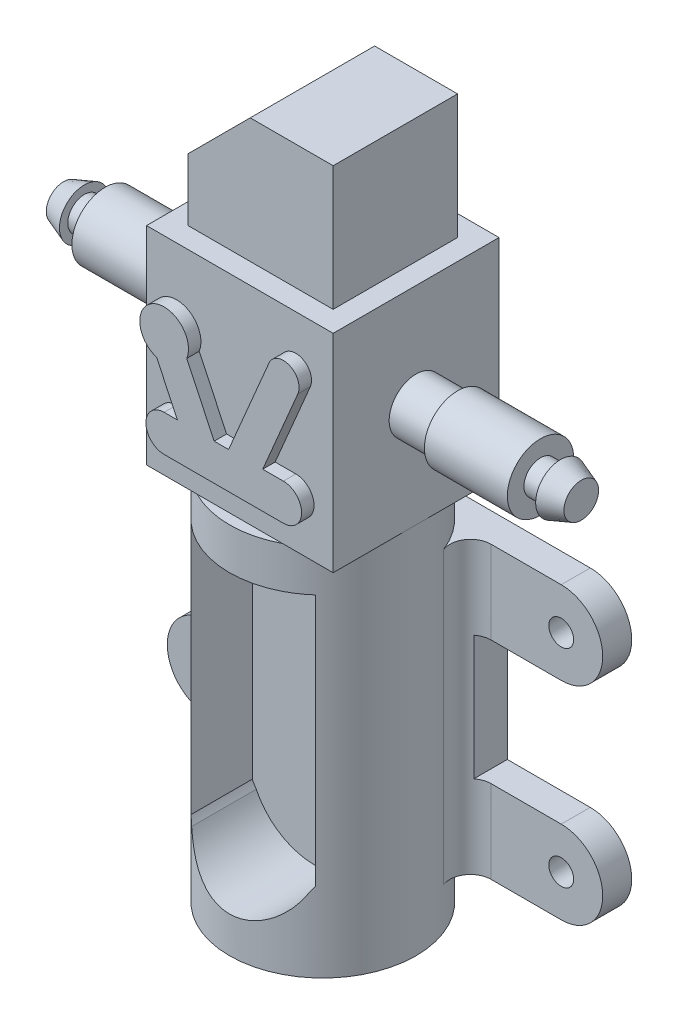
ISO-10303-21;
HEADER;
FILE_DESCRIPTION(('STEP AP214'),'2;1');
FILE_NAME('part.step','',(''),(''),'','','');
FILE_SCHEMA(('AUTOMOTIVE_DESIGN { 1 0 10303 214 1 1 1 1 }'));
ENDSEC;
DATA;
#1=APPLICATION_CONTEXT('core data for automotive mechanical design processes');
#2=APPLICATION_PROTOCOL_DEFINITION('international standard','automotive_design',2000,#1);
#3=PRODUCT_CONTEXT('',#1,'mechanical');
#4=PRODUCT('Part','Part','',(#3));
#5=PRODUCT_RELATED_PRODUCT_CATEGORY('part','',(#4));
#6=PRODUCT_DEFINITION_FORMATION('','',#4);
#7=PRODUCT_DEFINITION_CONTEXT('part definition',#1,'design');
#8=PRODUCT_DEFINITION('design','',#6,#7);
#9=PRODUCT_DEFINITION_SHAPE('','',#8);
#10=(LENGTH_UNIT() NAMED_UNIT(*) SI_UNIT(.MILLI.,.METRE.));
#11=(NAMED_UNIT(*) PLANE_ANGLE_UNIT() SI_UNIT($,.RADIAN.));
#12=(NAMED_UNIT(*) SI_UNIT($,.STERADIAN.) SOLID_ANGLE_UNIT());
#13=UNCERTAINTY_MEASURE_WITH_UNIT(LENGTH_MEASURE(1.E-05),#10,'distance_accuracy_value','');
#14=(GEOMETRIC_REPRESENTATION_CONTEXT(3) GLOBAL_UNCERTAINTY_ASSIGNED_CONTEXT((#13)) GLOBAL_UNIT_ASSIGNED_CONTEXT((#10,
#11,#12)) REPRESENTATION_CONTEXT('',''));
#15=CARTESIAN_POINT('',(0.,0.,0.));
#16=DIRECTION('',(0.,0.,1.));
#17=DIRECTION('',(1.,0.,0.));
#18=AXIS2_PLACEMENT_3D('',#15,#16,#17);
#19=CARTESIAN_POINT('',(0.,-155.,15.));
#20=DIRECTION('',(0.,1.,0.));
#21=DIRECTION('',(0.,0.,1.));
#22=AXIS2_PLACEMENT_3D('',#19,#20,#21);
#23=CYLINDRICAL_SURFACE('',#22,22.5);
#24=CARTESIAN_POINT('',(0.,-65.,15.));
#25=DIRECTION('',(0.,-1.,0.));
#26=DIRECTION('',(0.,0.,-1.));
#27=AXIS2_PLACEMENT_3D('',#24,#25,#26);
#28=CIRCLE('',#27,22.5);
#29=CARTESIAN_POINT('',(10.3077640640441,-65.,-5.));
#30=VERTEX_POINT('',#29);
#31=CARTESIAN_POINT('',(22.5,-65.,15.));
#32=VERTEX_POINT('',#31);
#33=EDGE_CURVE('E635',#30,#32,#28,.T.);
#34=ORIENTED_EDGE('',*,*,#33,.T.);
#35=CARTESIAN_POINT('',(10.3077640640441,-65.,35.));
#36=VERTEX_POINT('',#35);
#37=EDGE_CURVE('E661',#32,#36,#28,.T.);
#38=ORIENTED_EDGE('',*,*,#37,.T.);
#39=CARTESIAN_POINT('',(-10.3077640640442,-65.,35.));
#40=VERTEX_POINT('',#39);
#41=EDGE_CURVE('E638',#36,#40,#28,.T.);
#42=ORIENTED_EDGE('',*,*,#41,.T.);
#43=CARTESIAN_POINT('',(-22.5,-65.,15.));
#44=VERTEX_POINT('',#43);
#45=EDGE_CURVE('E1175',#40,#44,#28,.T.);
#46=ORIENTED_EDGE('',*,*,#45,.T.);
#47=CARTESIAN_POINT('',(-10.3077640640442,-65.,-5.00000000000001));
#48=VERTEX_POINT('',#47);
#49=EDGE_CURVE('E560',#44,#48,#28,.T.);
#50=ORIENTED_EDGE('',*,*,#49,.T.);
#51=EDGE_CURVE('E639',#48,#30,#28,.T.);
#52=ORIENTED_EDGE('',*,*,#51,.T.);
#53=EDGE_LOOP('',(#34,#38,#42,#46,#50,#52));
#54=FACE_BOUND('',#53,.T.);
#55=CARTESIAN_POINT('',(0.,-155.,15.));
#56=DIRECTION('',(0.,-1.,0.));
#57=DIRECTION('',(0.,0.,-1.));
#58=AXIS2_PLACEMENT_3D('',#55,#56,#57);
#59=CIRCLE('',#58,22.5);
#60=CARTESIAN_POINT('',(0.,-155.,-7.50000000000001));
#61=VERTEX_POINT('',#60);
#62=EDGE_CURVE('E619',#61,#61,#59,.T.);
#63=ORIENTED_EDGE('',*,*,#62,.F.);
#64=EDGE_LOOP('',(#63));
#65=FACE_BOUND('',#64,.T.);
#66=CARTESIAN_POINT('',(0.,-145.,15.));
#67=DIRECTION('',(0.,-1.,0.));
#68=DIRECTION('',(0.,0.,-1.));
#69=AXIS2_PLACEMENT_3D('',#66,#67,#68);
#70=CIRCLE('',#69,22.5);
#71=CARTESIAN_POINT('',(12.5,-145.,-3.70828693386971));
#72=VERTEX_POINT('',#71);
#73=CARTESIAN_POINT('',(20.959672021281,-145.,6.81818181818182));
#74=VERTEX_POINT('',#73);
#75=EDGE_CURVE('E545',#72,#74,#70,.T.);
#76=ORIENTED_EDGE('',*,*,#75,.T.);
#77=DIRECTION('',(0.,1.,0.));
#78=VECTOR('',#77,1.);
#79=CARTESIAN_POINT('',(20.959672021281,-155.,6.81818181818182));
#80=LINE('',#79,#78);
#81=CARTESIAN_POINT('',(20.959672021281,-75.0000000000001,6.81818181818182));
#82=VERTEX_POINT('',#81);
#83=EDGE_CURVE('E509',#74,#82,#80,.T.);
#84=ORIENTED_EDGE('',*,*,#83,.T.);
#85=CARTESIAN_POINT('',(0.,-75.,15.));
#86=DIRECTION('',(0.,1.,0.));
#87=DIRECTION('',(-1.,0.,0.));
#88=AXIS2_PLACEMENT_3D('',#85,#86,#87);
#89=CIRCLE('',#88,22.5);
#90=CARTESIAN_POINT('',(12.5,-75.0000000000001,-3.70828693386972));
#91=VERTEX_POINT('',#90);
#92=EDGE_CURVE('E549',#82,#91,#89,.T.);
#93=ORIENTED_EDGE('',*,*,#92,.T.);
#94=DIRECTION('',(0.,1.,0.));
#95=VECTOR('',#94,1.);
#96=CARTESIAN_POINT('',(12.5,-155.,-3.70828693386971));
#97=LINE('',#96,#95);
#98=EDGE_CURVE('E547',#91,#72,#97,.F.);
#99=ORIENTED_EDGE('',*,*,#98,.T.);
#100=EDGE_LOOP('',(#76,#84,#93,#99));
#101=FACE_BOUND('',#100,.T.);
#102=DIRECTION('',(0.,1.,0.));
#103=VECTOR('',#102,1.);
#104=CARTESIAN_POINT('',(-20.959672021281,-155.,6.81818181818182));
#105=LINE('',#104,#103);
#106=CARTESIAN_POINT('',(-20.959672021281,-75.0000000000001,6.81818181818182));
#107=VERTEX_POINT('',#106);
#108=CARTESIAN_POINT('',(-20.959672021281,-145.,6.81818181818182));
#109=VERTEX_POINT('',#108);
#110=EDGE_CURVE('E534',#107,#109,#105,.F.);
#111=ORIENTED_EDGE('',*,*,#110,.T.);
#112=CARTESIAN_POINT('',(0.,-145.,15.));
#113=DIRECTION('',(0.,-1.,0.));
#114=DIRECTION('',(0.,0.,-1.));
#115=AXIS2_PLACEMENT_3D('',#112,#113,#114);
#116=CIRCLE('',#115,22.5);
#117=CARTESIAN_POINT('',(-12.5,-145.,-3.7082869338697));
#118=VERTEX_POINT('',#117);
#119=EDGE_CURVE('E542',#109,#118,#116,.T.);
#120=ORIENTED_EDGE('',*,*,#119,.T.);
#121=DIRECTION('',(0.,1.,0.));
#122=VECTOR('',#121,1.);
#123=CARTESIAN_POINT('',(-12.5,-155.,-3.7082869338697));
#124=LINE('',#123,#122);
#125=CARTESIAN_POINT('',(-12.5,-75.,-3.7082869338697));
#126=VERTEX_POINT('',#125);
#127=EDGE_CURVE('E539',#118,#126,#124,.T.);
#128=ORIENTED_EDGE('',*,*,#127,.T.);
#129=CARTESIAN_POINT('',(0.,-75.0000000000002,15.));
#130=DIRECTION('',(0.,1.,0.));
#131=DIRECTION('',(-1.,0.,0.));
#132=AXIS2_PLACEMENT_3D('',#129,#130,#131);
#133=CIRCLE('',#132,22.5);
#134=EDGE_CURVE('E537',#126,#107,#133,.T.);
#135=ORIENTED_EDGE('',*,*,#134,.T.);
#136=EDGE_LOOP('',(#111,#120,#128,#135));
#137=FACE_BOUND('',#136,.T.);
#138=CARTESIAN_POINT('',(-15.,-135.868064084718,31.7705098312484));
#139=CARTESIAN_POINT('',(-14.8819946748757,-136.09546590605,31.8760645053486));
#140=CARTESIAN_POINT('',(-14.7592244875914,-136.319438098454,31.9836244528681));
#141=CARTESIAN_POINT('',(-14.5043744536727,-136.760467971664,32.2017785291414));
#142=CARTESIAN_POINT('',(-14.3722956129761,-136.977526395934,32.312372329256));
#143=CARTESIAN_POINT('',(-14.0990247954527,-137.404719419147,32.5356392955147));
#144=CARTESIAN_POINT('',(-13.9578329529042,-137.614854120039,32.6483124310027));
#145=CARTESIAN_POINT('',(-13.666496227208,-138.02813473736,32.8748692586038));
#146=CARTESIAN_POINT('',(-13.5163510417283,-138.23128041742,32.988752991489));
#147=CARTESIAN_POINT('',(-13.0496564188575,-138.834008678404,33.333216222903));
#148=CARTESIAN_POINT('',(-12.7194609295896,-139.222798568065,33.5644438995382));
#149=CARTESIAN_POINT('',(-12.0238666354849,-139.970351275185,34.0223588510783));
#150=CARTESIAN_POINT('',(-11.6584668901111,-140.329113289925,34.2490460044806));
#151=CARTESIAN_POINT('',(-10.8923431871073,-141.015412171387,34.6927177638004));
#152=CARTESIAN_POINT('',(-10.4915515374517,-141.342886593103,34.9096825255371));
#153=CARTESIAN_POINT('',(-9.65621541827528,-141.963095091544,35.3279551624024));
#154=CARTESIAN_POINT('',(-9.22166886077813,-142.255827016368,35.5292620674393));
#155=CARTESIAN_POINT('',(-8.32218206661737,-142.801986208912,35.9100103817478));
#156=CARTESIAN_POINT('',(-7.85738137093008,-143.055577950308,36.0895425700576));
#157=CARTESIAN_POINT('',(-7.1384076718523,-143.404492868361,36.3391091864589));
#158=CARTESIAN_POINT('',(-6.8951491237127,-143.515541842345,36.4190016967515));
#159=CARTESIAN_POINT('',(-6.40165255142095,-143.726721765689,36.5716375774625));
#160=CARTESIAN_POINT('',(-6.15141285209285,-143.826850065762,36.6443792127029));
#161=CARTESIAN_POINT('',(-5.53734970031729,-144.055541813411,36.8111741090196));
#162=CARTESIAN_POINT('',(-5.17022374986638,-144.178235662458,36.9012396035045));
#163=CARTESIAN_POINT('',(-4.42492543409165,-144.398899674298,37.0638955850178));
#164=CARTESIAN_POINT('',(-4.04675565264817,-144.496875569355,37.1364901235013));
#165=CARTESIAN_POINT('',(-3.28154581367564,-144.666832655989,37.2627891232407));
#166=CARTESIAN_POINT('',(-2.89450699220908,-144.738817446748,37.3164961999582));
#167=CARTESIAN_POINT('',(-2.11410375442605,-144.855757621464,37.4038997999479));
#168=CARTESIAN_POINT('',(-1.72073911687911,-144.900712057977,37.4375956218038));
#169=CARTESIAN_POINT('',(-0.929567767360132,-144.96296738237,37.4842907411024));
#170=CARTESIAN_POINT('',(-0.531752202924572,-144.980196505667,37.4972363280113));
#171=CARTESIAN_POINT('',(0.264227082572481,-144.986497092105,37.5019684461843));
#172=CARTESIAN_POINT('',(0.66239080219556,-144.975568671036,37.4937550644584));
#173=CARTESIAN_POINT('',(1.45600116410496,-144.925730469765,37.4563552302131));
#174=CARTESIAN_POINT('',(1.85144753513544,-144.8868179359,37.4271667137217));
#175=CARTESIAN_POINT('',(2.63661637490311,-144.781624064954,37.3484659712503));
#176=CARTESIAN_POINT('',(3.0263388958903,-144.715342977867,37.2989539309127));
#177=CARTESIAN_POINT('',(3.78271666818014,-144.559425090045,37.1829185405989));
#178=CARTESIAN_POINT('',(4.14968598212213,-144.470770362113,37.1171122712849));
#179=CARTESIAN_POINT('',(4.87374167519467,-144.270181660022,36.9689144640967));
#180=CARTESIAN_POINT('',(5.23082838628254,-144.158248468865,36.8865234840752));
#181=CARTESIAN_POINT('',(5.93336552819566,-143.912386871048,36.7066041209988));
#182=CARTESIAN_POINT('',(6.27881680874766,-143.77846007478,36.609076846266));
#183=CARTESIAN_POINT('',(6.95675782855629,-143.489932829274,36.4004519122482));
#184=CARTESIAN_POINT('',(7.28924595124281,-143.335329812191,36.2893525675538));
#185=CARTESIAN_POINT('',(7.97416689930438,-142.989619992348,36.0430172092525));
#186=CARTESIAN_POINT('',(8.3250553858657,-142.796387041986,35.906472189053));
#187=CARTESIAN_POINT('',(9.00861350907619,-142.38802766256,35.6211562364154));
#188=CARTESIAN_POINT('',(9.34128231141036,-142.172900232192,35.472384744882));
#189=CARTESIAN_POINT('',(9.98813066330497,-141.721949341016,35.1647139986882));
#190=CARTESIAN_POINT('',(10.3022832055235,-141.486096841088,35.0058006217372));
#191=CARTESIAN_POINT('',(10.9110951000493,-140.995256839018,34.6803755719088));
#192=CARTESIAN_POINT('',(11.2057526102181,-140.740267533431,34.513863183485));
#193=CARTESIAN_POINT('',(11.8475781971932,-140.145109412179,34.1326241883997));
#194=CARTESIAN_POINT('',(12.1890681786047,-139.799758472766,33.9163960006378));
#195=CARTESIAN_POINT('',(12.8402255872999,-139.082185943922,33.4805885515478));
#196=CARTESIAN_POINT('',(13.1498878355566,-138.709959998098,33.2610087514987));
#197=CARTESIAN_POINT('',(13.7358185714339,-137.940732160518,32.8244286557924));
#198=CARTESIAN_POINT('',(14.0121863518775,-137.543809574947,32.6074225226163));
#199=CARTESIAN_POINT('',(14.4016536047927,-136.92958874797,32.2878750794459));
#200=CARTESIAN_POINT('',(14.5272989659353,-136.721701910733,32.1823495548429));
#201=CARTESIAN_POINT('',(14.7700773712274,-136.299616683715,31.9741101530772));
#202=CARTESIAN_POINT('',(14.8872096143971,-136.085417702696,31.8713965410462));
#203=CARTESIAN_POINT('',(15.,-135.868064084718,31.7705098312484));
#204=B_SPLINE_CURVE_WITH_KNOTS('',3,(#138,#139,#140,#141,#142,#143,#144,#145,#146,#147,#148,
#149,#150,#151,#152,#153,#154,#155,#156,#157,#158,#159,#160,#161,#162,#163,#164,#165,#166,#167,
#168,#169,#170,#171,#172,#173,#174,#175,#176,#177,#178,#179,#180,#181,#182,#183,#184,#185,#186,
#187,#188,#189,#190,#191,#192,#193,#194,#195,#196,#197,#198,#199,#200,#201,#202,#203),
.UNSPECIFIED.,.F.,.F.,(4,2,2,2,2,2,2,2,2,2,2,2,2,2,2,2,2,2,2,2,2,2,2,2,2,2,2,2,2,2,2,2,4),(0.,
0.831167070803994,1.66224445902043,2.49330960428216,3.32440282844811,5.00246920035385,
6.68058041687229,8.36197381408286,10.043471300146,11.7176982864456,12.5546265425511,
13.3917573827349,14.5827238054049,15.7734137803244,16.9639388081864,18.1545055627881,
19.3481490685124,20.541787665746,21.7355437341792,22.9292888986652,24.0777202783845,
25.2261130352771,26.3744217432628,27.5228731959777,28.7912846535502,30.0597541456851,
31.3300302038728,32.6004261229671,34.1935765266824,35.7869857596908,37.3755187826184,
38.1698369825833,38.9642298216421),.UNSPECIFIED.);
#205=CARTESIAN_POINT('',(-15.,-135.868064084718,31.7705098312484));
#206=VERTEX_POINT('',#205);
#207=CARTESIAN_POINT('',(-14.0466911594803,-137.479989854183,32.5767024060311));
#208=VERTEX_POINT('',#207);
#209=EDGE_CURVE('E398',#206,#208,#204,.T.);
#210=ORIENTED_EDGE('',*,*,#209,.F.);
#211=DIRECTION('',(0.,1.,0.));
#212=VECTOR('',#211,1.);
#213=CARTESIAN_POINT('',(-15.,-155.,31.7705098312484));
#214=LINE('',#213,#212);
#215=CARTESIAN_POINT('',(-15.,-75.,31.7705098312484));
#216=VERTEX_POINT('',#215);
#217=EDGE_CURVE('E11',#216,#206,#214,.F.);
#218=ORIENTED_EDGE('',*,*,#217,.F.);
#219=CARTESIAN_POINT('',(0.,-75.,15.));
#220=DIRECTION('',(0.,-1.,0.));
#221=DIRECTION('',(0.,0.,-1.));
#222=AXIS2_PLACEMENT_3D('',#219,#220,#221);
#223=CIRCLE('',#222,22.5);
#224=CARTESIAN_POINT('',(15.,-75.,31.7705098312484));
#225=VERTEX_POINT('',#224);
#226=EDGE_CURVE('E494',#225,#216,#223,.T.);
#227=ORIENTED_EDGE('',*,*,#226,.F.);
#228=DIRECTION('',(0.,1.,0.));
#229=VECTOR('',#228,1.);
#230=CARTESIAN_POINT('',(15.,-155.,31.7705098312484));
#231=LINE('',#230,#229);
#232=CARTESIAN_POINT('',(15.,-135.868064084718,31.7705098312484));
#233=VERTEX_POINT('',#232);
#234=EDGE_CURVE('E492',#233,#225,#231,.T.);
#235=ORIENTED_EDGE('',*,*,#234,.F.);
#236=CARTESIAN_POINT('',(14.0466911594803,-137.479989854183,32.5767024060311));
#237=VERTEX_POINT('',#236);
#238=EDGE_CURVE('E407',#237,#233,#204,.T.);
#239=ORIENTED_EDGE('',*,*,#238,.F.);
#240=CARTESIAN_POINT('',(-15.,-135.,31.7705098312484));
#241=CARTESIAN_POINT('',(-14.8729576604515,-135.438721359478,31.8841452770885));
#242=CARTESIAN_POINT('',(-14.7277848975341,-135.868190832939,32.011401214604));
#243=CARTESIAN_POINT('',(-14.4037077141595,-136.706580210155,32.2866474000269));
#244=CARTESIAN_POINT('',(-14.2248531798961,-137.115529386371,32.434606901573));
#245=CARTESIAN_POINT('',(-13.8358838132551,-137.911456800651,32.7448621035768));
#246=CARTESIAN_POINT('',(-13.6258223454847,-138.298471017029,32.9071331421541));
#247=CARTESIAN_POINT('',(-13.1757700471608,-139.050727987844,33.2408217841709));
#248=CARTESIAN_POINT('',(-12.9357670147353,-139.415961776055,33.4122431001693));
#249=CARTESIAN_POINT('',(-12.4284761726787,-140.121924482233,33.7583793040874));
#250=CARTESIAN_POINT('',(-12.1613373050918,-140.462771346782,33.9330723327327));
#251=CARTESIAN_POINT('',(-11.5996990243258,-141.121151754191,34.2822799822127));
#252=CARTESIAN_POINT('',(-11.3052026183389,-141.438687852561,34.4567946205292));
#253=CARTESIAN_POINT('',(-10.6894781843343,-142.049447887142,34.8017587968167));
#254=CARTESIAN_POINT('',(-10.3682383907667,-142.342661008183,34.972206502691));
#255=CARTESIAN_POINT('',(-9.69995587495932,-142.903062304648,35.3051764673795));
#256=CARTESIAN_POINT('',(-9.35291476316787,-143.170252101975,35.4676992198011));
#257=CARTESIAN_POINT('',(-8.66931922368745,-143.651827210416,35.7657890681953));
#258=CARTESIAN_POINT('',(-8.33507376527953,-143.868821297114,35.9024366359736));
#259=CARTESIAN_POINT('',(-7.64747143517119,-144.27837761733,36.1636809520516));
#260=CARTESIAN_POINT('',(-7.29411756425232,-144.470943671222,36.2882795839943));
#261=CARTESIAN_POINT('',(-6.56985527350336,-144.829724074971,36.5228201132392));
#262=CARTESIAN_POINT('',(-6.19895762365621,-144.995954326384,36.6327708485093));
#263=CARTESIAN_POINT('',(-5.44125391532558,-145.3002756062,36.8356714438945));
#264=CARTESIAN_POINT('',(-5.05444782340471,-145.438366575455,36.9286212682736));
#265=CARTESIAN_POINT('',(-4.2643691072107,-145.685439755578,37.0959134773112));
#266=CARTESIAN_POINT('',(-3.860994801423,-145.794196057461,37.1701111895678));
#267=CARTESIAN_POINT('',(-3.04356228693,-145.979491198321,37.2970350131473));
#268=CARTESIAN_POINT('',(-2.62950398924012,-146.056029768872,37.3497609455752));
#269=CARTESIAN_POINT('',(-1.79452021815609,-146.1755034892,37.4322444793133));
#270=CARTESIAN_POINT('',(-1.37359861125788,-146.218456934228,37.4620145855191));
#271=CARTESIAN_POINT('',(-0.528672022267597,-146.270010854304,37.4977603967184));
#272=CARTESIAN_POINT('',(-0.104667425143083,-146.278615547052,37.5037390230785));
#273=CARTESIAN_POINT('',(0.689391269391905,-146.262407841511,37.4924926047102));
#274=CARTESIAN_POINT('',(1.05957655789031,-146.241630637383,37.4780693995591));
#275=CARTESIAN_POINT('',(1.79637113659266,-146.173970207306,37.4312120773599));
#276=CARTESIAN_POINT('',(2.16298077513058,-146.127089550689,37.3987797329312));
#277=CARTESIAN_POINT('',(2.89006708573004,-146.007885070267,37.3166170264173));
#278=CARTESIAN_POINT('',(3.25054348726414,-145.935560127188,37.2668859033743));
#279=CARTESIAN_POINT('',(3.96303542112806,-145.766425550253,37.1511766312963));
#280=CARTESIAN_POINT('',(4.31505063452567,-145.669614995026,37.085197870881));
#281=CARTESIAN_POINT('',(5.00818049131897,-145.452810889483,36.9384021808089));
#282=CARTESIAN_POINT('',(5.3493077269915,-145.332845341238,36.8576031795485));
#283=CARTESIAN_POINT('',(6.01944380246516,-145.070942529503,36.6826252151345));
#284=CARTESIAN_POINT('',(6.34845280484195,-144.929005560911,36.5884464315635));
#285=CARTESIAN_POINT('',(6.99300549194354,-144.624488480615,36.3883553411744));
#286=CARTESIAN_POINT('',(7.30855044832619,-144.461910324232,36.282444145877));
#287=CARTESIAN_POINT('',(7.92521531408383,-144.117361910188,36.0605881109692));
#288=CARTESIAN_POINT('',(8.22633325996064,-143.935389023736,35.9446419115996));
#289=CARTESIAN_POINT('',(8.85355992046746,-143.52705784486,35.6880271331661));
#290=CARTESIAN_POINT('',(9.17743972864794,-143.298034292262,35.5461478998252));
#291=CARTESIAN_POINT('',(9.80463228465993,-142.818011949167,35.254353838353));
#292=CARTESIAN_POINT('',(10.107943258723,-142.567011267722,35.1044383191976));
#293=CARTESIAN_POINT('',(10.6939073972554,-142.043818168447,34.7989827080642));
#294=CARTESIAN_POINT('',(10.9765179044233,-141.771584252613,34.6434319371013));
#295=CARTESIAN_POINT('',(11.5198306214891,-141.207413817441,34.3298191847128));
#296=CARTESIAN_POINT('',(11.7805315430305,-140.915476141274,34.17175705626));
#297=CARTESIAN_POINT('',(12.3221095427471,-140.261138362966,33.8291011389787));
#298=CARTESIAN_POINT('',(12.5988131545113,-139.895225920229,33.6445925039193));
#299=CARTESIAN_POINT('',(13.1202859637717,-139.138321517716,33.2813867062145));
#300=CARTESIAN_POINT('',(13.3650426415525,-138.747319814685,33.1026918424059));
#301=CARTESIAN_POINT('',(13.8200895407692,-137.942667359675,32.7577123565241));
#302=CARTESIAN_POINT('',(14.0305023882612,-137.529104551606,32.5913847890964));
#303=CARTESIAN_POINT('',(14.415668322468,-136.679297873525,32.2771593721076));
#304=CARTESIAN_POINT('',(14.5904593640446,-136.243078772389,32.1292419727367));
#305=CARTESIAN_POINT('',(14.7917615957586,-135.665492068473,31.9545702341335));
#306=CARTESIAN_POINT('',(14.8357741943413,-135.533588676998,31.9160573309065));
#307=CARTESIAN_POINT('',(14.9204276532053,-135.268073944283,31.8414374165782));
#308=CARTESIAN_POINT('',(14.9610694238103,-135.134463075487,31.8053297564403));
#309=CARTESIAN_POINT('',(15.,-135.,31.7705098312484));
#310=B_SPLINE_CURVE_WITH_KNOTS('',3,(#240,#241,#242,#243,#244,#245,#246,#247,#248,#249,#250,
#251,#252,#253,#254,#255,#256,#257,#258,#259,#260,#261,#262,#263,#264,#265,#266,#267,#268,#269,
#270,#271,#272,#273,#274,#275,#276,#277,#278,#279,#280,#281,#282,#283,#284,#285,#286,#287,#288,
#289,#290,#291,#292,#293,#294,#295,#296,#297,#298,#299,#300,#301,#302,#303,#304,#305,#306,#307,
#308,#309),.UNSPECIFIED.,.F.,.F.,(4,2,2,2,2,2,2,2,2,2,2,2,2,2,2,2,2,2,2,2,2,2,2,2,2,2,2,2,2,2,2,
2,2,2,4),(0.,1.41073911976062,2.81940499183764,4.22568916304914,5.63254831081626,
7.03206479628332,8.43142762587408,9.83140938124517,11.2313038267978,12.4939190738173,
13.756336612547,15.0179889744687,16.2796439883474,17.5507543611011,18.8218753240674,
20.0923033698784,21.362575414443,22.4743678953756,23.5860509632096,24.6977829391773,
25.8095567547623,26.9199943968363,28.0304171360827,29.1407347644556,30.2512030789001,
31.5138240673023,32.7765538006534,34.0418164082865,35.307153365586,36.7888708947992,
38.271167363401,39.7480496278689,41.223349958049,41.6561606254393,42.0888540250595),.UNSPECIFIED.);
#311=EDGE_CURVE('E49',#208,#237,#310,.T.);
#312=ORIENTED_EDGE('',*,*,#311,.F.);
#313=EDGE_LOOP('',(#210,#218,#227,#235,#239,#312));
#314=FACE_BOUND('',#313,.T.);
#315=ADVANCED_FACE('F41',(#54,#65,#101,#137,#314),#23,.T.);
#316=CARTESIAN_POINT('',(0.,-130.657216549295,53.));
#317=DIRECTION('',(0.,0.,-1.));
#318=DIRECTION('',(-1.,0.,0.));
#319=AXIS2_PLACEMENT_3D('',#316,#317,#318);
#320=CYLINDRICAL_SURFACE('',#319,15.6160099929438);
#321=ORIENTED_EDGE('',*,*,#311,.T.);
#322=DIRECTION('',(0.,0.,-1.));
#323=VECTOR('',#322,1.);
#324=CARTESIAN_POINT('',(14.0466911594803,-137.479989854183,31.));
#325=LINE('',#324,#323);
#326=CARTESIAN_POINT('',(14.0466911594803,-137.479989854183,17.));
#327=VERTEX_POINT('',#326);
#328=EDGE_CURVE('E406',#237,#327,#325,.T.);
#329=ORIENTED_EDGE('',*,*,#328,.T.);
#330=CARTESIAN_POINT('',(0.,-130.657216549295,17.));
#331=DIRECTION('',(0.,0.,1.));
#332=DIRECTION('',(1.,0.,0.));
#333=AXIS2_PLACEMENT_3D('',#330,#331,#332);
#334=CIRCLE('',#333,15.6160099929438);
#335=CARTESIAN_POINT('',(-14.0466911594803,-137.479989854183,17.));
#336=VERTEX_POINT('',#335);
#337=EDGE_CURVE('E376',#336,#327,#334,.T.);
#338=ORIENTED_EDGE('',*,*,#337,.F.);
#339=DIRECTION('',(0.,0.,-1.));
#340=VECTOR('',#339,1.);
#341=CARTESIAN_POINT('',(-14.0466911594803,-137.479989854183,31.));
#342=LINE('',#341,#340);
#343=EDGE_CURVE('E385',#336,#208,#342,.F.);
#344=ORIENTED_EDGE('',*,*,#343,.T.);
#345=EDGE_LOOP('',(#321,#329,#338,#344));
#346=FACE_BOUND('',#345,.T.);
#347=ADVANCED_FACE('F479',(#346),#320,.F.);
#348=CARTESIAN_POINT('',(-22.5,-65.,35.));
#349=DIRECTION('',(0.,0.,-1.));
#350=DIRECTION('',(-1.,0.,0.));
#351=AXIS2_PLACEMENT_3D('',#348,#349,#350);
#352=PLANE('',#351);
#353=DIRECTION('',(-1.,0.,0.));
#354=VECTOR('',#353,1.);
#355=CARTESIAN_POINT('',(-22.5,-15.,35.));
#356=LINE('',#355,#354);
#357=CARTESIAN_POINT('',(22.5,-15.,35.));
#358=VERTEX_POINT('',#357);
#359=CARTESIAN_POINT('',(-22.5,-15.,35.));
#360=VERTEX_POINT('',#359);
#361=EDGE_CURVE('E614',#358,#360,#356,.T.);
#362=ORIENTED_EDGE('',*,*,#361,.T.);
#363=DIRECTION('',(0.,1.,0.));
#364=VECTOR('',#363,1.);
#365=CARTESIAN_POINT('',(-22.5,-65.,35.));
#366=LINE('',#365,#364);
#367=CARTESIAN_POINT('',(-22.5,-65.,35.));
#368=VERTEX_POINT('',#367);
#369=EDGE_CURVE('E599',#368,#360,#366,.T.);
#370=ORIENTED_EDGE('',*,*,#369,.F.);
#371=DIRECTION('',(-1.,0.,0.));
#372=VECTOR('',#371,1.);
#373=CARTESIAN_POINT('',(-22.5,-65.,35.));
#374=LINE('',#373,#372);
#375=EDGE_CURVE('E631',#40,#368,#374,.T.);
#376=ORIENTED_EDGE('',*,*,#375,.F.);
#377=EDGE_CURVE('E630',#36,#40,#374,.T.);
#378=ORIENTED_EDGE('',*,*,#377,.F.);
#379=CARTESIAN_POINT('',(22.5,-65.,35.));
#380=VERTEX_POINT('',#379);
#381=EDGE_CURVE('E627',#380,#36,#374,.T.);
#382=ORIENTED_EDGE('',*,*,#381,.F.);
#383=DIRECTION('',(0.,1.,0.));
#384=VECTOR('',#383,1.);
#385=CARTESIAN_POINT('',(22.5,-65.,35.));
#386=LINE('',#385,#384);
#387=EDGE_CURVE('E587',#380,#358,#386,.T.);
#388=ORIENTED_EDGE('',*,*,#387,.T.);
#389=EDGE_LOOP('',(#362,#370,#376,#378,#382,#388));
#390=FACE_BOUND('',#389,.T.);
#391=DIRECTION('',(0.390873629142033,0.920444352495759,0.));
#392=VECTOR('',#391,1.);
#393=CARTESIAN_POINT('',(24.7962318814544,-10.5299066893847,35.));
#394=LINE('',#393,#392);
#395=CARTESIAN_POINT('',(8.51271214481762,-48.8749692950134,35.));
#396=VERTEX_POINT('',#395);
#397=CARTESIAN_POINT('',(16.9800224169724,-28.935819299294,35.));
#398=VERTEX_POINT('',#397);
#399=EDGE_CURVE('E64',#396,#398,#394,.T.);
#400=ORIENTED_EDGE('',*,*,#399,.F.);
#401=DIRECTION('',(1.,0.,0.));
#402=VECTOR('',#401,1.);
#403=CARTESIAN_POINT('',(0.,-48.8749692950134,35.));
#404=LINE('',#403,#402);
#405=CARTESIAN_POINT('',(13.4965473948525,-48.8749692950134,35.));
#406=VERTEX_POINT('',#405);
#407=EDGE_CURVE('E900',#396,#406,#404,.T.);
#408=ORIENTED_EDGE('',*,*,#407,.T.);
#409=CARTESIAN_POINT('',(13.4965473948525,-53.2760173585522,35.));
#410=DIRECTION('',(0.,0.,1.));
#411=DIRECTION('',(1.,0.,0.));
#412=AXIS2_PLACEMENT_3D('',#409,#410,#411);
#413=CIRCLE('',#412,4.40104806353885);
#414=CARTESIAN_POINT('',(13.4965473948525,-57.6770654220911,35.));
#415=VERTEX_POINT('',#414);
#416=EDGE_CURVE('E872',#415,#406,#413,.T.);
#417=ORIENTED_EDGE('',*,*,#416,.F.);
#418=DIRECTION('',(1.,0.,0.));
#419=VECTOR('',#418,1.);
#420=CARTESIAN_POINT('',(0.,-57.6770654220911,35.));
#421=LINE('',#420,#419);
#422=CARTESIAN_POINT('',(-15.256966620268,-57.6770654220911,35.));
#423=VERTEX_POINT('',#422);
#424=EDGE_CURVE('E876',#423,#415,#421,.T.);
#425=ORIENTED_EDGE('',*,*,#424,.F.);
#426=CARTESIAN_POINT('',(-15.256966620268,-53.2760173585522,35.));
#427=DIRECTION('',(0.,0.,1.));
#428=DIRECTION('',(1.,0.,0.));
#429=AXIS2_PLACEMENT_3D('',#426,#427,#428);
#430=CIRCLE('',#429,4.40104806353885);
#431=CARTESIAN_POINT('',(-15.256966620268,-48.8749692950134,35.));
#432=VERTEX_POINT('',#431);
#433=EDGE_CURVE('E879',#432,#423,#430,.T.);
#434=ORIENTED_EDGE('',*,*,#433,.F.);
#435=DIRECTION('',(1.,0.,0.));
#436=VECTOR('',#435,1.);
#437=CARTESIAN_POINT('',(0.,-48.8749692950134,35.));
#438=LINE('',#437,#436);
#439=CARTESIAN_POINT('',(-12.0615389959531,-48.8749692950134,35.));
#440=VERTEX_POINT('',#439);
#441=EDGE_CURVE('E882',#432,#440,#438,.T.);
#442=ORIENTED_EDGE('',*,*,#441,.T.);
#443=DIRECTION('',(-0.427379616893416,0.904072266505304,0.));
#444=VECTOR('',#443,1.);
#445=CARTESIAN_POINT('',(-28.7428699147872,-13.5875385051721,35.));
#446=LINE('',#445,#444);
#447=CARTESIAN_POINT('',(-17.0484662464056,-38.325700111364,35.));
#448=VERTEX_POINT('',#447);
#449=EDGE_CURVE('E884',#440,#448,#446,.T.);
#450=ORIENTED_EDGE('',*,*,#449,.T.);
#451=CARTESIAN_POINT('',(-15.256966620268,-32.7377930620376,35.));
#452=DIRECTION('',(0.,0.,1.));
#453=DIRECTION('',(1.,0.,0.));
#454=AXIS2_PLACEMENT_3D('',#451,#452,#453);
#455=CIRCLE('',#454,5.86806408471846);
#456=CARTESIAN_POINT('',(-9.80177970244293,-34.8999937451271,35.));
#457=VERTEX_POINT('',#456);
#458=EDGE_CURVE('E886',#457,#448,#455,.T.);
#459=ORIENTED_EDGE('',*,*,#458,.F.);
#460=DIRECTION('',(-0.427379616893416,0.904072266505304,0.));
#461=VECTOR('',#460,1.);
#462=CARTESIAN_POINT('',(-21.4961833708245,-10.1618321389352,35.));
#463=LINE('',#462,#461);
#464=CARTESIAN_POINT('',(-3.19542762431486,-48.8749692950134,35.));
#465=VERTEX_POINT('',#464);
#466=EDGE_CURVE('E889',#465,#457,#463,.T.);
#467=ORIENTED_EDGE('',*,*,#466,.F.);
#468=DIRECTION('',(1.,0.,0.));
#469=VECTOR('',#468,1.);
#470=CARTESIAN_POINT('',(0.,-48.8749692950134,35.));
#471=LINE('',#470,#469);
#472=CARTESIAN_POINT('',(0.289383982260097,-48.8749692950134,35.));
#473=VERTEX_POINT('',#472);
#474=EDGE_CURVE('E892',#465,#473,#471,.T.);
#475=ORIENTED_EDGE('',*,*,#474,.T.);
#476=DIRECTION('',(0.390873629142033,0.920444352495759,0.));
#477=VECTOR('',#476,1.);
#478=CARTESIAN_POINT('',(17.8292818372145,-7.57133886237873,35.));
#479=LINE('',#478,#477);
#480=CARTESIAN_POINT('',(10.0130723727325,-25.977251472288,35.));
#481=VERTEX_POINT('',#480);
#482=EDGE_CURVE('E894',#473,#481,#479,.T.);
#483=ORIENTED_EDGE('',*,*,#482,.T.);
#484=CARTESIAN_POINT('',(13.4965473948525,-27.456535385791,35.));
#485=DIRECTION('',(0.,0.,1.));
#486=DIRECTION('',(1.,0.,0.));
#487=AXIS2_PLACEMENT_3D('',#484,#485,#486);
#488=CIRCLE('',#487,3.7845579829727);
#489=EDGE_CURVE('E896',#398,#481,#488,.T.);
#490=ORIENTED_EDGE('',*,*,#489,.F.);
#491=EDGE_LOOP('',(#400,#408,#417,#425,#434,#442,#450,#459,#467,#475,#483,#490));
#492=FACE_BOUND('',#491,.T.);
#493=ADVANCED_FACE('F483',(#390,#492),#352,.F.);
#494=CARTESIAN_POINT('',(42.5,-85.0000000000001,0.));
#495=DIRECTION('',(0.,0.,-1.));
#496=DIRECTION('',(-1.,0.,0.));
#497=AXIS2_PLACEMENT_3D('',#494,#495,#496);
#498=PLANE('',#497);
#499=CARTESIAN_POINT('',(42.5,-85.0000000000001,0.));
#500=DIRECTION('',(0.,0.,1.));
#501=DIRECTION('',(-1.,0.,0.));
#502=AXIS2_PLACEMENT_3D('',#499,#500,#501);
#503=CIRCLE('',#502,3.);
#504=CARTESIAN_POINT('',(39.5,-85.0000000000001,0.));
#505=VERTEX_POINT('',#504);
#506=EDGE_CURVE('E752',#505,#505,#503,.T.);
#507=ORIENTED_EDGE('',*,*,#506,.F.);
#508=EDGE_LOOP('',(#507));
#509=FACE_BOUND('',#508,.T.);
#510=DIRECTION('',(-1.,0.,0.));
#511=VECTOR('',#510,1.);
#512=CARTESIAN_POINT('',(12.5,-75.0000000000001,0.));
#513=LINE('',#512,#511);
#514=CARTESIAN_POINT('',(42.5,-75.0000000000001,0.));
#515=VERTEX_POINT('',#514);
#516=CARTESIAN_POINT('',(25.617376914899,-75.0000000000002,0.));
#517=VERTEX_POINT('',#516);
#518=EDGE_CURVE('E710',#515,#517,#513,.T.);
#519=ORIENTED_EDGE('',*,*,#518,.T.);
#520=DIRECTION('',(0.,-1.,0.));
#521=VECTOR('',#520,1.);
#522=CARTESIAN_POINT('',(25.617376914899,-145.,0.));
#523=LINE('',#522,#521);
#524=CARTESIAN_POINT('',(25.617376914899,-95.,0.));
#525=VERTEX_POINT('',#524);
#526=EDGE_CURVE('E512',#517,#525,#523,.T.);
#527=ORIENTED_EDGE('',*,*,#526,.T.);
#528=DIRECTION('',(1.,0.,0.));
#529=VECTOR('',#528,1.);
#530=CARTESIAN_POINT('',(42.5,-95.,0.));
#531=LINE('',#530,#529);
#532=CARTESIAN_POINT('',(42.5,-95.,0.));
#533=VERTEX_POINT('',#532);
#534=EDGE_CURVE('E716',#525,#533,#531,.T.);
#535=ORIENTED_EDGE('',*,*,#534,.T.);
#536=CARTESIAN_POINT('',(42.5,-85.0000000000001,0.));
#537=DIRECTION('',(0.,0.,1.));
#538=DIRECTION('',(-1.,0.,0.));
#539=AXIS2_PLACEMENT_3D('',#536,#537,#538);
#540=CIRCLE('',#539,9.99999999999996);
#541=EDGE_CURVE('E713',#533,#515,#540,.T.);
#542=ORIENTED_EDGE('',*,*,#541,.T.);
#543=EDGE_LOOP('',(#519,#527,#535,#542));
#544=FACE_BOUND('',#543,.T.);
#545=ADVANCED_FACE('F952',(#509,#544),#498,.F.);
#546=CARTESIAN_POINT('',(-42.5000000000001,-135.,0.));
#547=DIRECTION('',(0.,0.,1.));
#548=DIRECTION('',(1.,0.,0.));
#549=AXIS2_PLACEMENT_3D('',#546,#547,#548);
#550=PLANE('',#549);
#551=CARTESIAN_POINT('',(-42.5000000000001,-135.,0.));
#552=DIRECTION('',(0.,0.,1.));
#553=DIRECTION('',(1.,0.,0.));
#554=AXIS2_PLACEMENT_3D('',#551,#552,#553);
#555=CIRCLE('',#554,3.);
#556=CARTESIAN_POINT('',(-39.5000000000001,-135.,0.));
#557=VERTEX_POINT('',#556);
#558=EDGE_CURVE('E823',#557,#557,#555,.T.);
#559=ORIENTED_EDGE('',*,*,#558,.F.);
#560=EDGE_LOOP('',(#559));
#561=FACE_BOUND('',#560,.T.);
#562=DIRECTION('',(1.,0.,0.));
#563=VECTOR('',#562,1.);
#564=CARTESIAN_POINT('',(-22.5,-145.,0.));
#565=LINE('',#564,#563);
#566=CARTESIAN_POINT('',(-42.5,-145.,0.));
#567=VERTEX_POINT('',#566);
#568=CARTESIAN_POINT('',(-25.617376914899,-145.,0.));
#569=VERTEX_POINT('',#568);
#570=EDGE_CURVE('E790',#567,#569,#565,.T.);
#571=ORIENTED_EDGE('',*,*,#570,.T.);
#572=DIRECTION('',(0.,1.,0.));
#573=VECTOR('',#572,1.);
#574=CARTESIAN_POINT('',(-25.617376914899,-135.,0.));
#575=LINE('',#574,#573);
#576=CARTESIAN_POINT('',(-25.617376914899,-125.,0.));
#577=VERTEX_POINT('',#576);
#578=EDGE_CURVE('E530',#569,#577,#575,.T.);
#579=ORIENTED_EDGE('',*,*,#578,.T.);
#580=DIRECTION('',(-1.,0.,0.));
#581=VECTOR('',#580,1.);
#582=CARTESIAN_POINT('',(-22.5,-125.,0.));
#583=LINE('',#582,#581);
#584=CARTESIAN_POINT('',(-42.5,-125.,0.));
#585=VERTEX_POINT('',#584);
#586=EDGE_CURVE('E779',#577,#585,#583,.T.);
#587=ORIENTED_EDGE('',*,*,#586,.T.);
#588=CARTESIAN_POINT('',(-42.5000000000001,-135.,0.));
#589=DIRECTION('',(0.,0.,1.));
#590=DIRECTION('',(1.,0.,0.));
#591=AXIS2_PLACEMENT_3D('',#588,#589,#590);
#592=CIRCLE('',#591,10.);
#593=EDGE_CURVE('E793',#585,#567,#592,.T.);
#594=ORIENTED_EDGE('',*,*,#593,.T.);
#595=EDGE_LOOP('',(#571,#579,#587,#594));
#596=FACE_BOUND('',#595,.T.);
#597=ADVANCED_FACE('F958',(#561,#596),#550,.T.);
#598=CARTESIAN_POINT('',(0.,-65.,0.));
#599=DIRECTION('',(0.,-1.,0.));
#600=DIRECTION('',(0.,0.,-1.));
#601=AXIS2_PLACEMENT_3D('',#598,#599,#600);
#602=PLANE('',#601);
#603=ORIENTED_EDGE('',*,*,#33,.F.);
#604=DIRECTION('',(1.,0.,0.));
#605=VECTOR('',#604,1.);
#606=CARTESIAN_POINT('',(-22.5,-65.,-5.00000000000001));
#607=LINE('',#606,#605);
#608=CARTESIAN_POINT('',(22.5,-65.,-5.00000000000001));
#609=VERTEX_POINT('',#608);
#610=EDGE_CURVE('E622',#30,#609,#607,.T.);
#611=ORIENTED_EDGE('',*,*,#610,.T.);
#612=DIRECTION('',(0.,0.,1.));
#613=VECTOR('',#612,1.);
#614=CARTESIAN_POINT('',(22.5,-65.,35.));
#615=LINE('',#614,#613);
#616=EDGE_CURVE('E632',#609,#32,#615,.T.);
#617=ORIENTED_EDGE('',*,*,#616,.T.);
#618=EDGE_LOOP('',(#603,#611,#617));
#619=FACE_BOUND('',#618,.T.);
#620=ADVANCED_FACE('F1167',(#619),#602,.T.);
#621=ORIENTED_EDGE('',*,*,#37,.F.);
#622=EDGE_CURVE('E611',#32,#380,#615,.T.);
#623=ORIENTED_EDGE('',*,*,#622,.T.);
#624=ORIENTED_EDGE('',*,*,#381,.T.);
#625=EDGE_LOOP('',(#621,#623,#624));
#626=FACE_BOUND('',#625,.T.);
#627=ADVANCED_FACE('F1204',(#626),#602,.T.);
#628=ORIENTED_EDGE('',*,*,#45,.F.);
#629=ORIENTED_EDGE('',*,*,#375,.T.);
#630=DIRECTION('',(0.,0.,-1.));
#631=VECTOR('',#630,1.);
#632=CARTESIAN_POINT('',(-22.5,-65.,35.));
#633=LINE('',#632,#631);
#634=EDGE_CURVE('E623',#368,#44,#633,.T.);
#635=ORIENTED_EDGE('',*,*,#634,.T.);
#636=EDGE_LOOP('',(#628,#629,#635));
#637=FACE_BOUND('',#636,.T.);
#638=ADVANCED_FACE('F1168',(#637),#602,.T.);
#639=CARTESIAN_POINT('',(17.5,15.,30.));
#640=DIRECTION('',(-1.,0.,0.));
#641=DIRECTION('',(0.,-1.,0.));
#642=AXIS2_PLACEMENT_3D('',#639,#640,#641);
#643=PLANE('',#642);
#644=DIRECTION('',(0.,1.,0.));
#645=VECTOR('',#644,1.);
#646=CARTESIAN_POINT('',(17.5,15.,0.));
#647=LINE('',#646,#645);
#648=CARTESIAN_POINT('',(17.5,-15.,0.));
#649=VERTEX_POINT('',#648);
#650=CARTESIAN_POINT('',(17.5,15.,0.));
#651=VERTEX_POINT('',#650);
#652=EDGE_CURVE('E584',#649,#651,#647,.T.);
#653=ORIENTED_EDGE('',*,*,#652,.T.);
#654=DIRECTION('',(0.,0.,-1.));
#655=VECTOR('',#654,1.);
#656=CARTESIAN_POINT('',(17.5,15.,30.));
#657=LINE('',#656,#655);
#658=CARTESIAN_POINT('',(17.5,15.,30.));
#659=VERTEX_POINT('',#658);
#660=EDGE_CURVE('E557',#659,#651,#657,.T.);
#661=ORIENTED_EDGE('',*,*,#660,.F.);
#662=DIRECTION('',(0.,1.,0.));
#663=VECTOR('',#662,1.);
#664=CARTESIAN_POINT('',(17.5,15.,30.));
#665=LINE('',#664,#663);
#666=CARTESIAN_POINT('',(17.5,-15.,30.));
#667=VERTEX_POINT('',#666);
#668=EDGE_CURVE('E576',#667,#659,#665,.T.);
#669=ORIENTED_EDGE('',*,*,#668,.F.);
#670=DIRECTION('',(0.,0.,-1.));
#671=VECTOR('',#670,1.);
#672=CARTESIAN_POINT('',(17.5,-15.,30.));
#673=LINE('',#672,#671);
#674=EDGE_CURVE('E570',#667,#649,#673,.T.);
#675=ORIENTED_EDGE('',*,*,#674,.T.);
#676=EDGE_LOOP('',(#653,#661,#669,#675));
#677=FACE_BOUND('',#676,.T.);
#678=ADVANCED_FACE('F1640',(#677),#643,.F.);
#679=CARTESIAN_POINT('',(17.5,15.,30.));
#680=DIRECTION('',(0.,-1.,0.));
#681=DIRECTION('',(1.,0.,0.));
#682=AXIS2_PLACEMENT_3D('',#679,#680,#681);
#683=PLANE('',#682);
#684=DIRECTION('',(-1.,0.,0.));
#685=VECTOR('',#684,1.);
#686=CARTESIAN_POINT('',(17.5,15.,0.));
#687=LINE('',#686,#685);
#688=CARTESIAN_POINT('',(-2.5,15.,0.));
#689=VERTEX_POINT('',#688);
#690=EDGE_CURVE('E582',#651,#689,#687,.T.);
#691=ORIENTED_EDGE('',*,*,#690,.T.);
#692=DIRECTION('',(0.,0.,-1.));
#693=VECTOR('',#692,1.);
#694=CARTESIAN_POINT('',(-2.5,15.,30.));
#695=LINE('',#694,#693);
#696=CARTESIAN_POINT('',(-2.5,15.,30.));
#697=VERTEX_POINT('',#696);
#698=EDGE_CURVE('E561',#697,#689,#695,.T.);
#699=ORIENTED_EDGE('',*,*,#698,.F.);
#700=DIRECTION('',(-1.,0.,0.));
#701=VECTOR('',#700,1.);
#702=CARTESIAN_POINT('',(17.5,15.,30.));
#703=LINE('',#702,#701);
#704=EDGE_CURVE('E593',#659,#697,#703,.T.);
#705=ORIENTED_EDGE('',*,*,#704,.F.);
#706=ORIENTED_EDGE('',*,*,#660,.T.);
#707=EDGE_LOOP('',(#691,#699,#705,#706));
#708=FACE_BOUND('',#707,.T.);
#709=ADVANCED_FACE('F1643',(#708),#683,.F.);
#710=CARTESIAN_POINT('',(-2.5,15.,30.));
#711=DIRECTION('',(0.707106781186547,-0.707106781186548,0.));
#712=DIRECTION('',(0.707106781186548,0.707106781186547,0.));
#713=AXIS2_PLACEMENT_3D('',#710,#711,#712);
#714=PLANE('',#713);
#715=DIRECTION('',(-0.707106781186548,-0.707106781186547,0.));
#716=VECTOR('',#715,1.);
#717=CARTESIAN_POINT('',(-2.5,15.,0.));
#718=LINE('',#717,#716);
#719=CARTESIAN_POINT('',(-17.5,0.,0.));
#720=VERTEX_POINT('',#719);
#721=EDGE_CURVE('E580',#689,#720,#718,.T.);
#722=ORIENTED_EDGE('',*,*,#721,.T.);
#723=DIRECTION('',(0.,0.,-1.));
#724=VECTOR('',#723,1.);
#725=CARTESIAN_POINT('',(-17.5,0.,30.));
#726=LINE('',#725,#724);
#727=CARTESIAN_POINT('',(-17.5,0.,30.));
#728=VERTEX_POINT('',#727);
#729=EDGE_CURVE('E564',#728,#720,#726,.T.);
#730=ORIENTED_EDGE('',*,*,#729,.F.);
#731=DIRECTION('',(-0.707106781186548,-0.707106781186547,0.));
#732=VECTOR('',#731,1.);
#733=CARTESIAN_POINT('',(-2.5,15.,30.));
#734=LINE('',#733,#732);
#735=EDGE_CURVE('E591',#697,#728,#734,.T.);
#736=ORIENTED_EDGE('',*,*,#735,.F.);
#737=ORIENTED_EDGE('',*,*,#698,.T.);
#738=EDGE_LOOP('',(#722,#730,#736,#737));
#739=FACE_BOUND('',#738,.T.);
#740=ADVANCED_FACE('F1647',(#739),#714,.F.);
#741=CARTESIAN_POINT('',(-17.5,0.,30.));
#742=DIRECTION('',(1.,0.,0.));
#743=DIRECTION('',(0.,1.,0.));
#744=AXIS2_PLACEMENT_3D('',#741,#742,#743);
#745=PLANE('',#744);
#746=DIRECTION('',(0.,-1.,0.));
#747=VECTOR('',#746,1.);
#748=CARTESIAN_POINT('',(-17.5,0.,0.));
#749=LINE('',#748,#747);
#750=CARTESIAN_POINT('',(-17.5,-15.,0.));
#751=VERTEX_POINT('',#750);
#752=EDGE_CURVE('E577',#720,#751,#749,.T.);
#753=ORIENTED_EDGE('',*,*,#752,.T.);
#754=DIRECTION('',(0.,0.,-1.));
#755=VECTOR('',#754,1.);
#756=CARTESIAN_POINT('',(-17.5,-15.,30.));
#757=LINE('',#756,#755);
#758=CARTESIAN_POINT('',(-17.5,-15.,30.));
#759=VERTEX_POINT('',#758);
#760=EDGE_CURVE('E567',#759,#751,#757,.T.);
#761=ORIENTED_EDGE('',*,*,#760,.F.);
#762=DIRECTION('',(0.,-1.,0.));
#763=VECTOR('',#762,1.);
#764=CARTESIAN_POINT('',(-17.5,0.,30.));
#765=LINE('',#764,#763);
#766=EDGE_CURVE('E589',#728,#759,#765,.T.);
#767=ORIENTED_EDGE('',*,*,#766,.F.);
#768=ORIENTED_EDGE('',*,*,#729,.T.);
#769=EDGE_LOOP('',(#753,#761,#767,#768));
#770=FACE_BOUND('',#769,.T.);
#771=ADVANCED_FACE('F1651',(#770),#745,.F.);
#772=CARTESIAN_POINT('',(0.,0.,30.));
#773=DIRECTION('',(0.,0.,1.));
#774=DIRECTION('',(1.,0.,0.));
#775=AXIS2_PLACEMENT_3D('',#772,#773,#774);
#776=PLANE('',#775);
#777=ORIENTED_EDGE('',*,*,#668,.T.);
#778=ORIENTED_EDGE('',*,*,#704,.T.);
#779=ORIENTED_EDGE('',*,*,#735,.T.);
#780=ORIENTED_EDGE('',*,*,#766,.T.);
#781=DIRECTION('',(1.,0.,0.));
#782=VECTOR('',#781,1.);
#783=CARTESIAN_POINT('',(-17.5,-15.,30.));
#784=LINE('',#783,#782);
#785=EDGE_CURVE('E572',#759,#667,#784,.T.);
#786=ORIENTED_EDGE('',*,*,#785,.T.);
#787=EDGE_LOOP('',(#777,#778,#779,#780,#786));
#788=FACE_BOUND('',#787,.T.);
#789=ADVANCED_FACE('F1655',(#788),#776,.T.);
#790=CARTESIAN_POINT('',(0.,0.,0.));
#791=DIRECTION('',(0.,0.,1.));
#792=DIRECTION('',(1.,0.,0.));
#793=AXIS2_PLACEMENT_3D('',#790,#791,#792);
#794=PLANE('',#793);
#795=ORIENTED_EDGE('',*,*,#652,.F.);
#796=DIRECTION('',(1.,0.,0.));
#797=VECTOR('',#796,1.);
#798=CARTESIAN_POINT('',(-17.5,-15.,0.));
#799=LINE('',#798,#797);
#800=EDGE_CURVE('E573',#751,#649,#799,.T.);
#801=ORIENTED_EDGE('',*,*,#800,.F.);
#802=ORIENTED_EDGE('',*,*,#752,.F.);
#803=ORIENTED_EDGE('',*,*,#721,.F.);
#804=ORIENTED_EDGE('',*,*,#690,.F.);
#805=EDGE_LOOP('',(#795,#801,#802,#803,#804));
#806=FACE_BOUND('',#805,.T.);
#807=ADVANCED_FACE('F1214',(#806),#794,.F.);
#808=CARTESIAN_POINT('',(0.,-15.,0.));
#809=DIRECTION('',(0.,-1.,0.));
#810=DIRECTION('',(0.,0.,-1.));
#811=AXIS2_PLACEMENT_3D('',#808,#809,#810);
#812=PLANE('',#811);
#813=DIRECTION('',(0.,0.,1.));
#814=VECTOR('',#813,1.);
#815=CARTESIAN_POINT('',(22.5,-15.,35.));
#816=LINE('',#815,#814);
#817=CARTESIAN_POINT('',(22.5,-15.,-5.00000000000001));
#818=VERTEX_POINT('',#817);
#819=EDGE_CURVE('E616',#818,#358,#816,.T.);
#820=ORIENTED_EDGE('',*,*,#819,.F.);
#821=DIRECTION('',(1.,0.,0.));
#822=VECTOR('',#821,1.);
#823=CARTESIAN_POINT('',(-22.5,-15.,-5.00000000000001));
#824=LINE('',#823,#822);
#825=CARTESIAN_POINT('',(-22.5,-15.,-5.00000000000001));
#826=VERTEX_POINT('',#825);
#827=EDGE_CURVE('E609',#826,#818,#824,.T.);
#828=ORIENTED_EDGE('',*,*,#827,.F.);
#829=DIRECTION('',(0.,0.,-1.));
#830=VECTOR('',#829,1.);
#831=CARTESIAN_POINT('',(-22.5,-15.,35.));
#832=LINE('',#831,#830);
#833=EDGE_CURVE('E612',#360,#826,#832,.T.);
#834=ORIENTED_EDGE('',*,*,#833,.F.);
#835=ORIENTED_EDGE('',*,*,#361,.F.);
#836=EDGE_LOOP('',(#820,#828,#834,#835));
#837=FACE_BOUND('',#836,.T.);
#838=ORIENTED_EDGE('',*,*,#760,.T.);
#839=ORIENTED_EDGE('',*,*,#800,.T.);
#840=ORIENTED_EDGE('',*,*,#674,.F.);
#841=ORIENTED_EDGE('',*,*,#785,.F.);
#842=EDGE_LOOP('',(#838,#839,#840,#841));
#843=FACE_BOUND('',#842,.T.);
#844=ADVANCED_FACE('F1192',(#837,#843),#812,.F.);
#845=CARTESIAN_POINT('',(22.5,-65.,35.));
#846=DIRECTION('',(-1.,0.,0.));
#847=DIRECTION('',(0.,0.,1.));
#848=AXIS2_PLACEMENT_3D('',#845,#846,#847);
#849=PLANE('',#848);
#850=CARTESIAN_POINT('',(22.5,-40.,15.));
#851=DIRECTION('',(-1.,0.,0.));
#852=DIRECTION('',(0.,0.,1.));
#853=AXIS2_PLACEMENT_3D('',#850,#851,#852);
#854=CIRCLE('',#853,6.5);
#855=CARTESIAN_POINT('',(22.5,-40.,21.5));
#856=VERTEX_POINT('',#855);
#857=EDGE_CURVE('E555',#856,#856,#854,.T.);
#858=ORIENTED_EDGE('',*,*,#857,.T.);
#859=EDGE_LOOP('',(#858));
#860=FACE_BOUND('',#859,.T.);
#861=ORIENTED_EDGE('',*,*,#819,.T.);
#862=ORIENTED_EDGE('',*,*,#387,.F.);
#863=ORIENTED_EDGE('',*,*,#622,.F.);
#864=ORIENTED_EDGE('',*,*,#616,.F.);
#865=DIRECTION('',(0.,1.,0.));
#866=VECTOR('',#865,1.);
#867=CARTESIAN_POINT('',(22.5,-65.,-5.00000000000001));
#868=LINE('',#867,#866);
#869=EDGE_CURVE('E605',#609,#818,#868,.T.);
#870=ORIENTED_EDGE('',*,*,#869,.T.);
#871=EDGE_LOOP('',(#861,#862,#863,#864,#870));
#872=FACE_BOUND('',#871,.T.);
#873=ADVANCED_FACE('F1199',(#860,#872),#849,.F.);
#874=CARTESIAN_POINT('',(-22.5,-65.,35.));
#875=DIRECTION('',(1.,0.,0.));
#876=DIRECTION('',(0.,0.,-1.));
#877=AXIS2_PLACEMENT_3D('',#874,#875,#876);
#878=PLANE('',#877);
#879=CARTESIAN_POINT('',(-22.5,-40.,15.));
#880=DIRECTION('',(1.,0.,0.));
#881=DIRECTION('',(0.,0.,-1.));
#882=AXIS2_PLACEMENT_3D('',#879,#880,#881);
#883=CIRCLE('',#882,6.5);
#884=CARTESIAN_POINT('',(-22.5,-40.,8.49999999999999));
#885=VERTEX_POINT('',#884);
#886=EDGE_CURVE('E552',#885,#885,#883,.T.);
#887=ORIENTED_EDGE('',*,*,#886,.T.);
#888=EDGE_LOOP('',(#887));
#889=FACE_BOUND('',#888,.T.);
#890=ORIENTED_EDGE('',*,*,#833,.T.);
#891=DIRECTION('',(0.,1.,0.));
#892=VECTOR('',#891,1.);
#893=CARTESIAN_POINT('',(-22.5,-65.,-5.00000000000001));
#894=LINE('',#893,#892);
#895=CARTESIAN_POINT('',(-22.5,-65.,-5.00000000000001));
#896=VERTEX_POINT('',#895);
#897=EDGE_CURVE('E602',#896,#826,#894,.T.);
#898=ORIENTED_EDGE('',*,*,#897,.F.);
#899=EDGE_CURVE('E626',#44,#896,#633,.T.);
#900=ORIENTED_EDGE('',*,*,#899,.F.);
#901=ORIENTED_EDGE('',*,*,#634,.F.);
#902=ORIENTED_EDGE('',*,*,#369,.T.);
#903=EDGE_LOOP('',(#890,#898,#900,#901,#902));
#904=FACE_BOUND('',#903,.T.);
#905=ADVANCED_FACE('F1184',(#889,#904),#878,.F.);
#906=CARTESIAN_POINT('',(-22.5,-65.,-5.00000000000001));
#907=DIRECTION('',(0.,0.,1.));
#908=DIRECTION('',(1.,0.,0.));
#909=AXIS2_PLACEMENT_3D('',#906,#907,#908);
#910=PLANE('',#909);
#911=ORIENTED_EDGE('',*,*,#827,.T.);
#912=ORIENTED_EDGE('',*,*,#869,.F.);
#913=ORIENTED_EDGE('',*,*,#610,.F.);
#914=EDGE_CURVE('E621',#48,#30,#607,.T.);
#915=ORIENTED_EDGE('',*,*,#914,.F.);
#916=EDGE_CURVE('E608',#896,#48,#607,.T.);
#917=ORIENTED_EDGE('',*,*,#916,.F.);
#918=ORIENTED_EDGE('',*,*,#897,.T.);
#919=EDGE_LOOP('',(#911,#912,#913,#915,#917,#918));
#920=FACE_BOUND('',#919,.T.);
#921=ADVANCED_FACE('F1165',(#920),#910,.F.);
#922=ORIENTED_EDGE('',*,*,#49,.F.);
#923=ORIENTED_EDGE('',*,*,#899,.T.);
#924=ORIENTED_EDGE('',*,*,#916,.T.);
#925=EDGE_LOOP('',(#922,#923,#924));
#926=FACE_BOUND('',#925,.T.);
#927=ADVANCED_FACE('F1158',(#926),#602,.T.);
#928=CARTESIAN_POINT('',(0.,-65.,15.));
#929=DIRECTION('',(0.,-1.,0.));
#930=DIRECTION('',(0.,0.,-1.));
#931=AXIS2_PLACEMENT_3D('',#928,#929,#930);
#932=PLANE('',#931);
#933=ORIENTED_EDGE('',*,*,#41,.F.);
#934=ORIENTED_EDGE('',*,*,#377,.T.);
#935=EDGE_LOOP('',(#933,#934));
#936=FACE_BOUND('',#935,.T.);
#937=ADVANCED_FACE('F1156',(#936),#932,.F.);
#938=ORIENTED_EDGE('',*,*,#51,.F.);
#939=ORIENTED_EDGE('',*,*,#914,.T.);
#940=EDGE_LOOP('',(#938,#939));
#941=FACE_BOUND('',#940,.T.);
#942=ADVANCED_FACE('F1154',(#941),#932,.F.);
#943=CARTESIAN_POINT('',(0.,-155.,15.));
#944=DIRECTION('',(0.,-1.,0.));
#945=DIRECTION('',(0.,0.,-1.));
#946=AXIS2_PLACEMENT_3D('',#943,#944,#945);
#947=PLANE('',#946);
#948=ORIENTED_EDGE('',*,*,#62,.T.);
#949=EDGE_LOOP('',(#948));
#950=FACE_BOUND('',#949,.T.);
#951=ADVANCED_FACE('F1152',(#950),#947,.T.);
#952=CARTESIAN_POINT('',(32.5,-40.,15.));
#953=DIRECTION('',(-1.,0.,0.));
#954=DIRECTION('',(0.,0.,1.));
#955=AXIS2_PLACEMENT_3D('',#952,#953,#954);
#956=CYLINDRICAL_SURFACE('',#955,6.5);
#957=CARTESIAN_POINT('',(-32.5,-40.,15.));
#958=DIRECTION('',(-1.,0.,0.));
#959=DIRECTION('',(0.,0.,1.));
#960=AXIS2_PLACEMENT_3D('',#957,#958,#959);
#961=CIRCLE('',#960,6.5);
#962=CARTESIAN_POINT('',(-32.5,-40.,21.5));
#963=VERTEX_POINT('',#962);
#964=EDGE_CURVE('E556',#963,#963,#961,.T.);
#965=ORIENTED_EDGE('',*,*,#964,.F.);
#966=EDGE_LOOP('',(#965));
#967=FACE_BOUND('',#966,.T.);
#968=ORIENTED_EDGE('',*,*,#886,.F.);
#969=EDGE_LOOP('',(#968));
#970=FACE_BOUND('',#969,.T.);
#971=ADVANCED_FACE('F1150',(#967,#970),#956,.T.);
#972=CARTESIAN_POINT('',(32.5,-40.,15.));
#973=DIRECTION('',(-1.,0.,0.));
#974=DIRECTION('',(0.,0.,1.));
#975=AXIS2_PLACEMENT_3D('',#972,#973,#974);
#976=CIRCLE('',#975,6.5);
#977=CARTESIAN_POINT('',(32.5,-40.,21.5));
#978=VERTEX_POINT('',#977);
#979=EDGE_CURVE('E644',#978,#978,#976,.T.);
#980=ORIENTED_EDGE('',*,*,#979,.T.);
#981=EDGE_LOOP('',(#980));
#982=FACE_BOUND('',#981,.T.);
#983=ORIENTED_EDGE('',*,*,#857,.F.);
#984=EDGE_LOOP('',(#983));
#985=FACE_BOUND('',#984,.T.);
#986=ADVANCED_FACE('F1146',(#982,#985),#956,.T.);
#987=CARTESIAN_POINT('',(-52.5,-40.,15.));
#988=DIRECTION('',(1.,0.,0.));
#989=DIRECTION('',(0.,0.,-1.));
#990=AXIS2_PLACEMENT_3D('',#987,#988,#989);
#991=CYLINDRICAL_SURFACE('',#990,8.);
#992=CARTESIAN_POINT('',(-52.5,-40.,15.));
#993=DIRECTION('',(-1.,0.,0.));
#994=DIRECTION('',(0.,0.,1.));
#995=AXIS2_PLACEMENT_3D('',#992,#993,#994);
#996=CIRCLE('',#995,8.);
#997=CARTESIAN_POINT('',(-52.5,-40.,23.));
#998=VERTEX_POINT('',#997);
#999=EDGE_CURVE('E651',#998,#998,#996,.T.);
#1000=ORIENTED_EDGE('',*,*,#999,.F.);
#1001=EDGE_LOOP('',(#1000));
#1002=FACE_BOUND('',#1001,.T.);
#1003=CARTESIAN_POINT('',(-32.5,-40.,15.));
#1004=DIRECTION('',(-1.,0.,0.));
#1005=DIRECTION('',(0.,0.,1.));
#1006=AXIS2_PLACEMENT_3D('',#1003,#1004,#1005);
#1007=CIRCLE('',#1006,8.);
#1008=CARTESIAN_POINT('',(-32.5,-40.,23.));
#1009=VERTEX_POINT('',#1008);
#1010=EDGE_CURVE('E652',#1009,#1009,#1007,.T.);
#1011=ORIENTED_EDGE('',*,*,#1010,.T.);
#1012=EDGE_LOOP('',(#1011));
#1013=FACE_BOUND('',#1012,.T.);
#1014=ADVANCED_FACE('F1139',(#1002,#1013),#991,.T.);
#1015=CARTESIAN_POINT('',(-52.5,-40.,15.));
#1016=DIRECTION('',(-1.,0.,0.));
#1017=DIRECTION('',(0.,0.,1.));
#1018=AXIS2_PLACEMENT_3D('',#1015,#1016,#1017);
#1019=PLANE('',#1018);
#1020=CARTESIAN_POINT('',(-52.5,-40.,15.));
#1021=DIRECTION('',(-1.,0.,0.));
#1022=DIRECTION('',(0.,0.,1.));
#1023=AXIS2_PLACEMENT_3D('',#1020,#1021,#1022);
#1024=CIRCLE('',#1023,4.);
#1025=CARTESIAN_POINT('',(-52.5,-40.,19.));
#1026=VERTEX_POINT('',#1025);
#1027=EDGE_CURVE('E658',#1026,#1026,#1024,.T.);
#1028=ORIENTED_EDGE('',*,*,#1027,.F.);
#1029=EDGE_LOOP('',(#1028));
#1030=FACE_BOUND('',#1029,.T.);
#1031=ORIENTED_EDGE('',*,*,#999,.T.);
#1032=EDGE_LOOP('',(#1031));
#1033=FACE_BOUND('',#1032,.T.);
#1034=ADVANCED_FACE('F1136',(#1030,#1033),#1019,.T.);
#1035=CARTESIAN_POINT('',(-32.5,-40.,15.));
#1036=DIRECTION('',(-1.,0.,0.));
#1037=DIRECTION('',(0.,0.,1.));
#1038=AXIS2_PLACEMENT_3D('',#1035,#1036,#1037);
#1039=PLANE('',#1038);
#1040=ORIENTED_EDGE('',*,*,#964,.T.);
#1041=EDGE_LOOP('',(#1040));
#1042=FACE_BOUND('',#1041,.T.);
#1043=ORIENTED_EDGE('',*,*,#1010,.F.);
#1044=EDGE_LOOP('',(#1043));
#1045=FACE_BOUND('',#1044,.T.);
#1046=ADVANCED_FACE('F1134',(#1042,#1045),#1039,.F.);
#1047=CARTESIAN_POINT('',(-57.5,-40.,15.));
#1048=DIRECTION('',(1.,0.,0.));
#1049=DIRECTION('',(0.,0.,-1.));
#1050=AXIS2_PLACEMENT_3D('',#1047,#1048,#1049);
#1051=CYLINDRICAL_SURFACE('',#1050,4.);
#1052=CARTESIAN_POINT('',(-57.5,-40.,15.));
#1053=DIRECTION('',(-1.,0.,0.));
#1054=DIRECTION('',(0.,0.,1.));
#1055=AXIS2_PLACEMENT_3D('',#1052,#1053,#1054);
#1056=CIRCLE('',#1055,4.);
#1057=CARTESIAN_POINT('',(-57.5,-40.,19.));
#1058=VERTEX_POINT('',#1057);
#1059=EDGE_CURVE('E655',#1058,#1058,#1056,.T.);
#1060=ORIENTED_EDGE('',*,*,#1059,.F.);
#1061=EDGE_LOOP('',(#1060));
#1062=FACE_BOUND('',#1061,.T.);
#1063=ORIENTED_EDGE('',*,*,#1027,.T.);
#1064=EDGE_LOOP('',(#1063));
#1065=FACE_BOUND('',#1064,.T.);
#1066=ADVANCED_FACE('F1130',(#1062,#1065),#1051,.T.);
#1067=CARTESIAN_POINT('',(-57.5,-40.,15.));
#1068=DIRECTION('',(1.,0.,0.));
#1069=DIRECTION('',(0.,0.,1.));
#1070=AXIS2_PLACEMENT_3D('',#1067,#1068,#1069);
#1071=CONICAL_SURFACE('',#1070,6.,0.349065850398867);
#1072=CARTESIAN_POINT('',(-62.5,-40.,15.));
#1073=DIRECTION('',(-1.,0.,0.));
#1074=DIRECTION('',(0.,0.,1.));
#1075=AXIS2_PLACEMENT_3D('',#1072,#1073,#1074);
#1076=CIRCLE('',#1075,4.18014882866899);
#1077=CARTESIAN_POINT('',(-62.5,-40.,19.180148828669));
#1078=VERTEX_POINT('',#1077);
#1079=EDGE_CURVE('E664',#1078,#1078,#1076,.T.);
#1080=ORIENTED_EDGE('',*,*,#1079,.F.);
#1081=EDGE_LOOP('',(#1080));
#1082=FACE_BOUND('',#1081,.T.);
#1083=CARTESIAN_POINT('',(-57.5,-40.,15.));
#1084=DIRECTION('',(-1.,0.,0.));
#1085=DIRECTION('',(0.,0.,1.));
#1086=AXIS2_PLACEMENT_3D('',#1083,#1084,#1085);
#1087=CIRCLE('',#1086,6.);
#1088=CARTESIAN_POINT('',(-57.5,-40.,21.));
#1089=VERTEX_POINT('',#1088);
#1090=EDGE_CURVE('E647',#1089,#1089,#1087,.T.);
#1091=ORIENTED_EDGE('',*,*,#1090,.T.);
#1092=EDGE_LOOP('',(#1091));
#1093=FACE_BOUND('',#1092,.T.);
#1094=ADVANCED_FACE('F1123',(#1082,#1093),#1071,.T.);
#1095=CARTESIAN_POINT('',(-62.5,-40.,15.));
#1096=DIRECTION('',(-1.,0.,0.));
#1097=DIRECTION('',(0.,0.,1.));
#1098=AXIS2_PLACEMENT_3D('',#1095,#1096,#1097);
#1099=PLANE('',#1098);
#1100=ORIENTED_EDGE('',*,*,#1079,.T.);
#1101=EDGE_LOOP('',(#1100));
#1102=FACE_BOUND('',#1101,.T.);
#1103=ADVANCED_FACE('F1120',(#1102),#1099,.T.);
#1104=CARTESIAN_POINT('',(-57.5,-40.,15.));
#1105=DIRECTION('',(-1.,0.,0.));
#1106=DIRECTION('',(0.,0.,1.));
#1107=AXIS2_PLACEMENT_3D('',#1104,#1105,#1106);
#1108=PLANE('',#1107);
#1109=ORIENTED_EDGE('',*,*,#1059,.T.);
#1110=EDGE_LOOP('',(#1109));
#1111=FACE_BOUND('',#1110,.T.);
#1112=ORIENTED_EDGE('',*,*,#1090,.F.);
#1113=EDGE_LOOP('',(#1112));
#1114=FACE_BOUND('',#1113,.T.);
#1115=ADVANCED_FACE('F1118',(#1111,#1114),#1108,.F.);
#1116=CARTESIAN_POINT('',(52.5,-40.,15.));
#1117=DIRECTION('',(-1.,0.,0.));
#1118=DIRECTION('',(0.,0.,1.));
#1119=AXIS2_PLACEMENT_3D('',#1116,#1117,#1118);
#1120=CYLINDRICAL_SURFACE('',#1119,8.);
#1121=CARTESIAN_POINT('',(52.5,-40.,15.));
#1122=DIRECTION('',(1.,0.,0.));
#1123=DIRECTION('',(0.,0.,-1.));
#1124=AXIS2_PLACEMENT_3D('',#1121,#1122,#1123);
#1125=CIRCLE('',#1124,8.);
#1126=CARTESIAN_POINT('',(52.5,-40.,6.99999999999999));
#1127=VERTEX_POINT('',#1126);
#1128=EDGE_CURVE('E648',#1127,#1127,#1125,.T.);
#1129=ORIENTED_EDGE('',*,*,#1128,.F.);
#1130=EDGE_LOOP('',(#1129));
#1131=FACE_BOUND('',#1130,.T.);
#1132=CARTESIAN_POINT('',(32.5,-40.,15.));
#1133=DIRECTION('',(1.,0.,0.));
#1134=DIRECTION('',(0.,0.,-1.));
#1135=AXIS2_PLACEMENT_3D('',#1132,#1133,#1134);
#1136=CIRCLE('',#1135,8.);
#1137=CARTESIAN_POINT('',(32.5,-40.,6.99999999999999));
#1138=VERTEX_POINT('',#1137);
#1139=EDGE_CURVE('E669',#1138,#1138,#1136,.T.);
#1140=ORIENTED_EDGE('',*,*,#1139,.T.);
#1141=EDGE_LOOP('',(#1140));
#1142=FACE_BOUND('',#1141,.T.);
#1143=ADVANCED_FACE('F1111',(#1131,#1142),#1120,.T.);
#1144=CARTESIAN_POINT('',(52.5,-40.,15.));
#1145=DIRECTION('',(1.,0.,0.));
#1146=DIRECTION('',(0.,0.,-1.));
#1147=AXIS2_PLACEMENT_3D('',#1144,#1145,#1146);
#1148=PLANE('',#1147);
#1149=CARTESIAN_POINT('',(52.5,-40.,15.));
#1150=DIRECTION('',(1.,0.,0.));
#1151=DIRECTION('',(0.,0.,-1.));
#1152=AXIS2_PLACEMENT_3D('',#1149,#1150,#1151);
#1153=CIRCLE('',#1152,4.);
#1154=CARTESIAN_POINT('',(52.5,-40.,11.));
#1155=VERTEX_POINT('',#1154);
#1156=EDGE_CURVE('E551',#1155,#1155,#1153,.T.);
#1157=ORIENTED_EDGE('',*,*,#1156,.F.);
#1158=EDGE_LOOP('',(#1157));
#1159=FACE_BOUND('',#1158,.T.);
#1160=ORIENTED_EDGE('',*,*,#1128,.T.);
#1161=EDGE_LOOP('',(#1160));
#1162=FACE_BOUND('',#1161,.T.);
#1163=ADVANCED_FACE('F1108',(#1159,#1162),#1148,.T.);
#1164=CARTESIAN_POINT('',(32.5,-40.,15.));
#1165=DIRECTION('',(1.,0.,0.));
#1166=DIRECTION('',(0.,0.,-1.));
#1167=AXIS2_PLACEMENT_3D('',#1164,#1165,#1166);
#1168=PLANE('',#1167);
#1169=ORIENTED_EDGE('',*,*,#979,.F.);
#1170=EDGE_LOOP('',(#1169));
#1171=FACE_BOUND('',#1170,.T.);
#1172=ORIENTED_EDGE('',*,*,#1139,.F.);
#1173=EDGE_LOOP('',(#1172));
#1174=FACE_BOUND('',#1173,.T.);
#1175=ADVANCED_FACE('F1106',(#1171,#1174),#1168,.F.);
#1176=CARTESIAN_POINT('',(57.5,-40.,15.));
#1177=DIRECTION('',(-1.,0.,0.));
#1178=DIRECTION('',(0.,0.,1.));
#1179=AXIS2_PLACEMENT_3D('',#1176,#1177,#1178);
#1180=CYLINDRICAL_SURFACE('',#1179,4.);
#1181=CARTESIAN_POINT('',(57.5,-40.,15.));
#1182=DIRECTION('',(1.,0.,0.));
#1183=DIRECTION('',(0.,0.,-1.));
#1184=AXIS2_PLACEMENT_3D('',#1181,#1182,#1183);
#1185=CIRCLE('',#1184,4.);
#1186=CARTESIAN_POINT('',(57.5,-40.,11.));
#1187=VERTEX_POINT('',#1186);
#1188=EDGE_CURVE('E672',#1187,#1187,#1185,.T.);
#1189=ORIENTED_EDGE('',*,*,#1188,.F.);
#1190=EDGE_LOOP('',(#1189));
#1191=FACE_BOUND('',#1190,.T.);
#1192=ORIENTED_EDGE('',*,*,#1156,.T.);
#1193=EDGE_LOOP('',(#1192));
#1194=FACE_BOUND('',#1193,.T.);
#1195=ADVANCED_FACE('F1102',(#1191,#1194),#1180,.T.);
#1196=CARTESIAN_POINT('',(57.5,-39.7794699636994,15.1646854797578));
#1197=DIRECTION('',(-1.,0.,0.));
#1198=DIRECTION('',(0.,0.,-1.));
#1199=AXIS2_PLACEMENT_3D('',#1196,#1197,#1198);
#1200=CONICAL_SURFACE('',#1199,6.,0.349065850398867);
#1201=CARTESIAN_POINT('',(62.5,-39.7794699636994,15.1646854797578));
#1202=DIRECTION('',(1.,0.,0.));
#1203=DIRECTION('',(0.,0.,-1.));
#1204=AXIS2_PLACEMENT_3D('',#1201,#1202,#1203);
#1205=CIRCLE('',#1204,4.18014882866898);
#1206=CARTESIAN_POINT('',(62.5,-39.7794699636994,10.9845366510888));
#1207=VERTEX_POINT('',#1206);
#1208=EDGE_CURVE('E679',#1207,#1207,#1205,.T.);
#1209=ORIENTED_EDGE('',*,*,#1208,.F.);
#1210=EDGE_LOOP('',(#1209));
#1211=FACE_BOUND('',#1210,.T.);
#1212=CARTESIAN_POINT('',(57.5,-39.7794699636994,15.1646854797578));
#1213=DIRECTION('',(1.,0.,0.));
#1214=DIRECTION('',(0.,0.,-1.));
#1215=AXIS2_PLACEMENT_3D('',#1212,#1213,#1214);
#1216=CIRCLE('',#1215,6.);
#1217=CARTESIAN_POINT('',(57.5,-39.7794699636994,9.16468547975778));
#1218=VERTEX_POINT('',#1217);
#1219=EDGE_CURVE('E682',#1218,#1218,#1216,.T.);
#1220=ORIENTED_EDGE('',*,*,#1219,.T.);
#1221=EDGE_LOOP('',(#1220));
#1222=FACE_BOUND('',#1221,.T.);
#1223=ADVANCED_FACE('F1095',(#1211,#1222),#1200,.T.);
#1224=CARTESIAN_POINT('',(62.5,-39.7794699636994,15.1646854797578));
#1225=DIRECTION('',(1.,0.,0.));
#1226=DIRECTION('',(0.,0.,-1.));
#1227=AXIS2_PLACEMENT_3D('',#1224,#1225,#1226);
#1228=PLANE('',#1227);
#1229=ORIENTED_EDGE('',*,*,#1208,.T.);
#1230=EDGE_LOOP('',(#1229));
#1231=FACE_BOUND('',#1230,.T.);
#1232=ADVANCED_FACE('F1092',(#1231),#1228,.T.);
#1233=CARTESIAN_POINT('',(57.5,-39.7794699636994,15.1646854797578));
#1234=DIRECTION('',(1.,0.,0.));
#1235=DIRECTION('',(0.,0.,-1.));
#1236=AXIS2_PLACEMENT_3D('',#1233,#1234,#1235);
#1237=PLANE('',#1236);
#1238=ORIENTED_EDGE('',*,*,#1188,.T.);
#1239=EDGE_LOOP('',(#1238));
#1240=FACE_BOUND('',#1239,.T.);
#1241=ORIENTED_EDGE('',*,*,#1219,.F.);
#1242=EDGE_LOOP('',(#1241));
#1243=FACE_BOUND('',#1242,.T.);
#1244=ADVANCED_FACE('F1068',(#1240,#1243),#1237,.F.);
#1245=CARTESIAN_POINT('',(12.5,-75.0000000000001,-7.));
#1246=DIRECTION('',(-1.,0.,0.));
#1247=DIRECTION('',(0.,-1.,0.));
#1248=AXIS2_PLACEMENT_3D('',#1245,#1246,#1247);
#1249=PLANE('',#1248);
#1250=ORIENTED_EDGE('',*,*,#98,.F.);
#1251=DIRECTION('',(0.,0.,1.));
#1252=VECTOR('',#1251,1.);
#1253=CARTESIAN_POINT('',(12.5,-75.0000000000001,-7.));
#1254=LINE('',#1253,#1252);
#1255=CARTESIAN_POINT('',(12.5,-75.0000000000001,-7.));
#1256=VERTEX_POINT('',#1255);
#1257=EDGE_CURVE('E702',#1256,#91,#1254,.T.);
#1258=ORIENTED_EDGE('',*,*,#1257,.F.);
#1259=DIRECTION('',(0.,-1.,0.));
#1260=VECTOR('',#1259,1.);
#1261=CARTESIAN_POINT('',(12.5,-75.0000000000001,-7.));
#1262=LINE('',#1261,#1260);
#1263=CARTESIAN_POINT('',(12.5,-145.,-7.));
#1264=VERTEX_POINT('',#1263);
#1265=EDGE_CURVE('E690',#1256,#1264,#1262,.T.);
#1266=ORIENTED_EDGE('',*,*,#1265,.T.);
#1267=DIRECTION('',(0.,0.,1.));
#1268=VECTOR('',#1267,1.);
#1269=CARTESIAN_POINT('',(12.5,-145.,-7.));
#1270=LINE('',#1269,#1268);
#1271=EDGE_CURVE('E685',#1264,#72,#1270,.T.);
#1272=ORIENTED_EDGE('',*,*,#1271,.T.);
#1273=EDGE_LOOP('',(#1250,#1258,#1266,#1272));
#1274=FACE_BOUND('',#1273,.T.);
#1275=ADVANCED_FACE('F1060',(#1274),#1249,.T.);
#1276=CARTESIAN_POINT('',(42.5,-135.,0.));
#1277=DIRECTION('',(0.,0.,1.));
#1278=DIRECTION('',(-1.,0.,0.));
#1279=AXIS2_PLACEMENT_3D('',#1276,#1277,#1278);
#1280=CIRCLE('',#1279,3.);
#1281=CARTESIAN_POINT('',(39.5,-135.,0.));
#1282=VERTEX_POINT('',#1281);
#1283=EDGE_CURVE('E746',#1282,#1282,#1280,.T.);
#1284=ORIENTED_EDGE('',*,*,#1283,.F.);
#1285=EDGE_LOOP('',(#1284));
#1286=FACE_BOUND('',#1285,.T.);
#1287=DIRECTION('',(-1.,0.,0.));
#1288=VECTOR('',#1287,1.);
#1289=CARTESIAN_POINT('',(22.5,-125.,0.));
#1290=LINE('',#1289,#1288);
#1291=CARTESIAN_POINT('',(42.5,-125.,0.));
#1292=VERTEX_POINT('',#1291);
#1293=CARTESIAN_POINT('',(25.617376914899,-125.,0.));
#1294=VERTEX_POINT('',#1293);
#1295=EDGE_CURVE('E718',#1292,#1294,#1290,.T.);
#1296=ORIENTED_EDGE('',*,*,#1295,.T.);
#1297=DIRECTION('',(0.,-1.,0.));
#1298=VECTOR('',#1297,1.);
#1299=CARTESIAN_POINT('',(25.617376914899,-145.,0.));
#1300=LINE('',#1299,#1298);
#1301=CARTESIAN_POINT('',(25.617376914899,-145.,0.));
#1302=VERTEX_POINT('',#1301);
#1303=EDGE_CURVE('E515',#1294,#1302,#1300,.T.);
#1304=ORIENTED_EDGE('',*,*,#1303,.T.);
#1305=DIRECTION('',(1.,0.,0.));
#1306=VECTOR('',#1305,1.);
#1307=CARTESIAN_POINT('',(22.5,-145.,0.));
#1308=LINE('',#1307,#1306);
#1309=CARTESIAN_POINT('',(42.5,-145.,0.));
#1310=VERTEX_POINT('',#1309);
#1311=EDGE_CURVE('E707',#1302,#1310,#1308,.T.);
#1312=ORIENTED_EDGE('',*,*,#1311,.T.);
#1313=CARTESIAN_POINT('',(42.5,-135.,0.));
#1314=DIRECTION('',(0.,0.,1.));
#1315=DIRECTION('',(-1.,0.,0.));
#1316=AXIS2_PLACEMENT_3D('',#1313,#1314,#1315);
#1317=CIRCLE('',#1316,9.99999999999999);
#1318=EDGE_CURVE('E721',#1310,#1292,#1317,.T.);
#1319=ORIENTED_EDGE('',*,*,#1318,.T.);
#1320=EDGE_LOOP('',(#1296,#1304,#1312,#1319));
#1321=FACE_BOUND('',#1320,.T.);
#1322=ADVANCED_FACE('F961',(#1286,#1321),#498,.F.);
#1323=CARTESIAN_POINT('',(22.5,-145.,-7.));
#1324=DIRECTION('',(0.,-1.,0.));
#1325=DIRECTION('',(0.,0.,-1.));
#1326=AXIS2_PLACEMENT_3D('',#1323,#1324,#1325);
#1327=PLANE('',#1326);
#1328=ORIENTED_EDGE('',*,*,#75,.F.);
#1329=ORIENTED_EDGE('',*,*,#1271,.F.);
#1330=DIRECTION('',(1.,0.,0.));
#1331=VECTOR('',#1330,1.);
#1332=CARTESIAN_POINT('',(42.5,-145.,-7.));
#1333=LINE('',#1332,#1331);
#1334=CARTESIAN_POINT('',(42.5,-145.,-7.));
#1335=VERTEX_POINT('',#1334);
#1336=EDGE_CURVE('E709',#1264,#1335,#1333,.T.);
#1337=ORIENTED_EDGE('',*,*,#1336,.T.);
#1338=DIRECTION('',(0.,0.,1.));
#1339=VECTOR('',#1338,1.);
#1340=CARTESIAN_POINT('',(42.5,-145.,-7.));
#1341=LINE('',#1340,#1339);
#1342=EDGE_CURVE('E686',#1335,#1310,#1341,.T.);
#1343=ORIENTED_EDGE('',*,*,#1342,.T.);
#1344=ORIENTED_EDGE('',*,*,#1311,.F.);
#1345=CARTESIAN_POINT('',(25.617376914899,-145.,5.));
#1346=DIRECTION('',(0.,-1.,0.));
#1347=DIRECTION('',(0.,0.,-1.));
#1348=AXIS2_PLACEMENT_3D('',#1345,#1346,#1347);
#1349=CIRCLE('',#1348,5.);
#1350=EDGE_CURVE('E498',#1302,#74,#1349,.F.);
#1351=ORIENTED_EDGE('',*,*,#1350,.T.);
#1352=EDGE_LOOP('',(#1328,#1329,#1337,#1343,#1344,#1351));
#1353=FACE_BOUND('',#1352,.T.);
#1354=ADVANCED_FACE('F1059',(#1353),#1327,.T.);
#1355=CARTESIAN_POINT('',(12.5,-75.0000000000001,-7.));
#1356=DIRECTION('',(0.,1.,0.));
#1357=DIRECTION('',(-1.,0.,0.));
#1358=AXIS2_PLACEMENT_3D('',#1355,#1356,#1357);
#1359=PLANE('',#1358);
#1360=ORIENTED_EDGE('',*,*,#92,.F.);
#1361=CARTESIAN_POINT('',(25.617376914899,-75.0000000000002,5.));
#1362=DIRECTION('',(0.,1.,0.));
#1363=DIRECTION('',(-1.,0.,0.));
#1364=AXIS2_PLACEMENT_3D('',#1361,#1362,#1363);
#1365=CIRCLE('',#1364,5.);
#1366=EDGE_CURVE('E496',#82,#517,#1365,.F.);
#1367=ORIENTED_EDGE('',*,*,#1366,.T.);
#1368=ORIENTED_EDGE('',*,*,#518,.F.);
#1369=DIRECTION('',(0.,0.,1.));
#1370=VECTOR('',#1369,1.);
#1371=CARTESIAN_POINT('',(42.5,-75.0000000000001,-7.));
#1372=LINE('',#1371,#1370);
#1373=CARTESIAN_POINT('',(42.5,-75.0000000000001,-7.));
#1374=VERTEX_POINT('',#1373);
#1375=EDGE_CURVE('E699',#1374,#515,#1372,.T.);
#1376=ORIENTED_EDGE('',*,*,#1375,.F.);
#1377=DIRECTION('',(-1.,0.,0.));
#1378=VECTOR('',#1377,1.);
#1379=CARTESIAN_POINT('',(42.5,-75.0000000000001,-7.));
#1380=LINE('',#1379,#1378);
#1381=EDGE_CURVE('E727',#1374,#1256,#1380,.T.);
#1382=ORIENTED_EDGE('',*,*,#1381,.T.);
#1383=ORIENTED_EDGE('',*,*,#1257,.T.);
#1384=EDGE_LOOP('',(#1360,#1367,#1368,#1376,#1382,#1383));
#1385=FACE_BOUND('',#1384,.T.);
#1386=ADVANCED_FACE('F1064',(#1385),#1359,.T.);
#1387=CARTESIAN_POINT('',(42.5,-85.0000000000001,-7.));
#1388=DIRECTION('',(0.,0.,1.));
#1389=DIRECTION('',(1.,0.,0.));
#1390=AXIS2_PLACEMENT_3D('',#1387,#1388,#1389);
#1391=CYLINDRICAL_SURFACE('',#1390,9.99999999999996);
#1392=ORIENTED_EDGE('',*,*,#541,.F.);
#1393=DIRECTION('',(0.,0.,1.));
#1394=VECTOR('',#1393,1.);
#1395=CARTESIAN_POINT('',(42.5,-95.,-7.));
#1396=LINE('',#1395,#1394);
#1397=CARTESIAN_POINT('',(42.5,-95.,-7.));
#1398=VERTEX_POINT('',#1397);
#1399=EDGE_CURVE('E696',#1398,#533,#1396,.T.);
#1400=ORIENTED_EDGE('',*,*,#1399,.F.);
#1401=CARTESIAN_POINT('',(42.5,-85.0000000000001,-7.));
#1402=DIRECTION('',(0.,0.,1.));
#1403=DIRECTION('',(-1.,0.,0.));
#1404=AXIS2_PLACEMENT_3D('',#1401,#1402,#1403);
#1405=CIRCLE('',#1404,9.99999999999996);
#1406=EDGE_CURVE('E729',#1398,#1374,#1405,.T.);
#1407=ORIENTED_EDGE('',*,*,#1406,.T.);
#1408=ORIENTED_EDGE('',*,*,#1375,.T.);
#1409=EDGE_LOOP('',(#1392,#1400,#1407,#1408));
#1410=FACE_BOUND('',#1409,.T.);
#1411=ADVANCED_FACE('F1072',(#1410),#1391,.T.);
#1412=CARTESIAN_POINT('',(42.5,-95.,-7.));
#1413=DIRECTION('',(0.,-1.,0.));
#1414=DIRECTION('',(0.,0.,-1.));
#1415=AXIS2_PLACEMENT_3D('',#1412,#1413,#1414);
#1416=PLANE('',#1415);
#1417=ORIENTED_EDGE('',*,*,#534,.F.);
#1418=CARTESIAN_POINT('',(25.617376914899,-95.,5.));
#1419=DIRECTION('',(0.,-1.,0.));
#1420=DIRECTION('',(0.,0.,-1.));
#1421=AXIS2_PLACEMENT_3D('',#1418,#1419,#1420);
#1422=CIRCLE('',#1421,5.);
#1423=CARTESIAN_POINT('',(22.5,-95.,1.09078509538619));
#1424=VERTEX_POINT('',#1423);
#1425=EDGE_CURVE('E506',#525,#1424,#1422,.F.);
#1426=ORIENTED_EDGE('',*,*,#1425,.T.);
#1427=DIRECTION('',(0.,0.,1.));
#1428=VECTOR('',#1427,1.);
#1429=CARTESIAN_POINT('',(22.5,-95.,-7.));
#1430=LINE('',#1429,#1428);
#1431=CARTESIAN_POINT('',(22.5,-95.,-7.));
#1432=VERTEX_POINT('',#1431);
#1433=EDGE_CURVE('E694',#1432,#1424,#1430,.T.);
#1434=ORIENTED_EDGE('',*,*,#1433,.F.);
#1435=DIRECTION('',(1.,0.,0.));
#1436=VECTOR('',#1435,1.);
#1437=CARTESIAN_POINT('',(42.5,-95.,-7.));
#1438=LINE('',#1437,#1436);
#1439=EDGE_CURVE('E732',#1432,#1398,#1438,.T.);
#1440=ORIENTED_EDGE('',*,*,#1439,.T.);
#1441=ORIENTED_EDGE('',*,*,#1399,.T.);
#1442=EDGE_LOOP('',(#1417,#1426,#1434,#1440,#1441));
#1443=FACE_BOUND('',#1442,.T.);
#1444=ADVANCED_FACE('F1076',(#1443),#1416,.T.);
#1445=CARTESIAN_POINT('',(22.5,-95.,-7.));
#1446=DIRECTION('',(1.,0.,0.));
#1447=DIRECTION('',(0.,1.,0.));
#1448=AXIS2_PLACEMENT_3D('',#1445,#1446,#1447);
#1449=PLANE('',#1448);
#1450=ORIENTED_EDGE('',*,*,#1433,.T.);
#1451=DIRECTION('',(0.,1.,0.));
#1452=VECTOR('',#1451,1.);
#1453=CARTESIAN_POINT('',(22.5,-95.,1.09078509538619));
#1454=LINE('',#1453,#1452);
#1455=CARTESIAN_POINT('',(22.5,-125.,1.0907850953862));
#1456=VERTEX_POINT('',#1455);
#1457=EDGE_CURVE('E503',#1424,#1456,#1454,.F.);
#1458=ORIENTED_EDGE('',*,*,#1457,.T.);
#1459=DIRECTION('',(0.,0.,1.));
#1460=VECTOR('',#1459,1.);
#1461=CARTESIAN_POINT('',(22.5,-125.,-7.));
#1462=LINE('',#1461,#1460);
#1463=CARTESIAN_POINT('',(22.5,-125.,-7.));
#1464=VERTEX_POINT('',#1463);
#1465=EDGE_CURVE('E692',#1464,#1456,#1462,.T.);
#1466=ORIENTED_EDGE('',*,*,#1465,.F.);
#1467=DIRECTION('',(0.,1.,0.));
#1468=VECTOR('',#1467,1.);
#1469=CARTESIAN_POINT('',(22.5,-95.,-7.));
#1470=LINE('',#1469,#1468);
#1471=EDGE_CURVE('E735',#1464,#1432,#1470,.T.);
#1472=ORIENTED_EDGE('',*,*,#1471,.T.);
#1473=EDGE_LOOP('',(#1450,#1458,#1466,#1472));
#1474=FACE_BOUND('',#1473,.T.);
#1475=ADVANCED_FACE('F1080',(#1474),#1449,.T.);
#1476=CARTESIAN_POINT('',(22.5,-125.,-7.));
#1477=DIRECTION('',(0.,1.,0.));
#1478=DIRECTION('',(0.,0.,1.));
#1479=AXIS2_PLACEMENT_3D('',#1476,#1477,#1478);
#1480=PLANE('',#1479);
#1481=ORIENTED_EDGE('',*,*,#1295,.F.);
#1482=DIRECTION('',(0.,0.,1.));
#1483=VECTOR('',#1482,1.);
#1484=CARTESIAN_POINT('',(42.5,-125.,-7.));
#1485=LINE('',#1484,#1483);
#1486=CARTESIAN_POINT('',(42.5,-125.,-7.));
#1487=VERTEX_POINT('',#1486);
#1488=EDGE_CURVE('E689',#1487,#1292,#1485,.T.);
#1489=ORIENTED_EDGE('',*,*,#1488,.F.);
#1490=DIRECTION('',(-1.,0.,0.));
#1491=VECTOR('',#1490,1.);
#1492=CARTESIAN_POINT('',(22.5,-125.,-7.));
#1493=LINE('',#1492,#1491);
#1494=EDGE_CURVE('E738',#1487,#1464,#1493,.T.);
#1495=ORIENTED_EDGE('',*,*,#1494,.T.);
#1496=ORIENTED_EDGE('',*,*,#1465,.T.);
#1497=CARTESIAN_POINT('',(25.617376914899,-125.,5.));
#1498=DIRECTION('',(0.,1.,0.));
#1499=DIRECTION('',(0.,0.,1.));
#1500=AXIS2_PLACEMENT_3D('',#1497,#1498,#1499);
#1501=CIRCLE('',#1500,5.);
#1502=EDGE_CURVE('E501',#1456,#1294,#1501,.F.);
#1503=ORIENTED_EDGE('',*,*,#1502,.T.);
#1504=EDGE_LOOP('',(#1481,#1489,#1495,#1496,#1503));
#1505=FACE_BOUND('',#1504,.T.);
#1506=ADVANCED_FACE('F1084',(#1505),#1480,.T.);
#1507=CARTESIAN_POINT('',(42.5,-135.,-7.));
#1508=DIRECTION('',(0.,0.,1.));
#1509=DIRECTION('',(1.,0.,0.));
#1510=AXIS2_PLACEMENT_3D('',#1507,#1508,#1509);
#1511=CYLINDRICAL_SURFACE('',#1510,9.99999999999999);
#1512=ORIENTED_EDGE('',*,*,#1318,.F.);
#1513=ORIENTED_EDGE('',*,*,#1342,.F.);
#1514=CARTESIAN_POINT('',(42.5,-135.,-7.));
#1515=DIRECTION('',(0.,0.,1.));
#1516=DIRECTION('',(-1.,0.,0.));
#1517=AXIS2_PLACEMENT_3D('',#1514,#1515,#1516);
#1518=CIRCLE('',#1517,9.99999999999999);
#1519=EDGE_CURVE('E741',#1335,#1487,#1518,.T.);
#1520=ORIENTED_EDGE('',*,*,#1519,.T.);
#1521=ORIENTED_EDGE('',*,*,#1488,.T.);
#1522=EDGE_LOOP('',(#1512,#1513,#1520,#1521));
#1523=FACE_BOUND('',#1522,.T.);
#1524=ADVANCED_FACE('F1055',(#1523),#1511,.T.);
#1525=CARTESIAN_POINT('',(42.5,-85.0000000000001,-7.));
#1526=DIRECTION('',(0.,0.,-1.));
#1527=DIRECTION('',(-1.,0.,0.));
#1528=AXIS2_PLACEMENT_3D('',#1525,#1526,#1527);
#1529=PLANE('',#1528);
#1530=CARTESIAN_POINT('',(42.5,-85.0000000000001,-7.));
#1531=DIRECTION('',(0.,0.,1.));
#1532=DIRECTION('',(-1.,0.,0.));
#1533=AXIS2_PLACEMENT_3D('',#1530,#1531,#1532);
#1534=CIRCLE('',#1533,3.);
#1535=CARTESIAN_POINT('',(39.5,-85.0000000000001,-7.));
#1536=VERTEX_POINT('',#1535);
#1537=EDGE_CURVE('E749',#1536,#1536,#1534,.T.);
#1538=ORIENTED_EDGE('',*,*,#1537,.T.);
#1539=EDGE_LOOP('',(#1538));
#1540=FACE_BOUND('',#1539,.T.);
#1541=CARTESIAN_POINT('',(42.5,-135.,-7.));
#1542=DIRECTION('',(0.,0.,1.));
#1543=DIRECTION('',(-1.,0.,0.));
#1544=AXIS2_PLACEMENT_3D('',#1541,#1542,#1543);
#1545=CIRCLE('',#1544,3.);
#1546=CARTESIAN_POINT('',(39.5,-135.,-7.));
#1547=VERTEX_POINT('',#1546);
#1548=EDGE_CURVE('E724',#1547,#1547,#1545,.T.);
#1549=ORIENTED_EDGE('',*,*,#1548,.T.);
#1550=EDGE_LOOP('',(#1549));
#1551=FACE_BOUND('',#1550,.T.);
#1552=ORIENTED_EDGE('',*,*,#1336,.F.);
#1553=ORIENTED_EDGE('',*,*,#1265,.F.);
#1554=ORIENTED_EDGE('',*,*,#1381,.F.);
#1555=ORIENTED_EDGE('',*,*,#1406,.F.);
#1556=ORIENTED_EDGE('',*,*,#1439,.F.);
#1557=ORIENTED_EDGE('',*,*,#1471,.F.);
#1558=ORIENTED_EDGE('',*,*,#1494,.F.);
#1559=ORIENTED_EDGE('',*,*,#1519,.F.);
#1560=EDGE_LOOP('',(#1552,#1553,#1554,#1555,#1556,#1557,#1558,#1559));
#1561=FACE_BOUND('',#1560,.T.);
#1562=ADVANCED_FACE('F1052',(#1540,#1551,#1561),#1529,.T.);
#1563=CARTESIAN_POINT('',(42.5,-135.,-7.));
#1564=DIRECTION('',(0.,0.,1.));
#1565=DIRECTION('',(1.,0.,0.));
#1566=AXIS2_PLACEMENT_3D('',#1563,#1564,#1565);
#1567=CYLINDRICAL_SURFACE('',#1566,3.);
#1568=ORIENTED_EDGE('',*,*,#1548,.F.);
#1569=EDGE_LOOP('',(#1568));
#1570=FACE_BOUND('',#1569,.T.);
#1571=ORIENTED_EDGE('',*,*,#1283,.T.);
#1572=EDGE_LOOP('',(#1571));
#1573=FACE_BOUND('',#1572,.T.);
#1574=ADVANCED_FACE('F1048',(#1570,#1573),#1567,.F.);
#1575=CARTESIAN_POINT('',(42.5,-85.0000000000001,-7.));
#1576=DIRECTION('',(0.,0.,1.));
#1577=DIRECTION('',(1.,0.,0.));
#1578=AXIS2_PLACEMENT_3D('',#1575,#1576,#1577);
#1579=CYLINDRICAL_SURFACE('',#1578,3.);
#1580=ORIENTED_EDGE('',*,*,#1537,.F.);
#1581=EDGE_LOOP('',(#1580));
#1582=FACE_BOUND('',#1581,.T.);
#1583=ORIENTED_EDGE('',*,*,#506,.T.);
#1584=EDGE_LOOP('',(#1583));
#1585=FACE_BOUND('',#1584,.T.);
#1586=ADVANCED_FACE('F1041',(#1582,#1585),#1579,.F.);
#1587=CARTESIAN_POINT('',(-12.5,-75.,-7.));
#1588=DIRECTION('',(1.,0.,0.));
#1589=DIRECTION('',(0.,1.,0.));
#1590=AXIS2_PLACEMENT_3D('',#1587,#1588,#1589);
#1591=PLANE('',#1590);
#1592=ORIENTED_EDGE('',*,*,#127,.F.);
#1593=DIRECTION('',(0.,0.,1.));
#1594=VECTOR('',#1593,1.);
#1595=CARTESIAN_POINT('',(-12.5,-145.,-7.));
#1596=LINE('',#1595,#1594);
#1597=CARTESIAN_POINT('',(-12.5,-145.,-7.));
#1598=VERTEX_POINT('',#1597);
#1599=EDGE_CURVE('E761',#1598,#118,#1596,.T.);
#1600=ORIENTED_EDGE('',*,*,#1599,.F.);
#1601=DIRECTION('',(0.,1.,0.));
#1602=VECTOR('',#1601,1.);
#1603=CARTESIAN_POINT('',(-12.5,-75.,-7.));
#1604=LINE('',#1603,#1602);
#1605=CARTESIAN_POINT('',(-12.5,-75.,-7.));
#1606=VERTEX_POINT('',#1605);
#1607=EDGE_CURVE('E810',#1598,#1606,#1604,.T.);
#1608=ORIENTED_EDGE('',*,*,#1607,.T.);
#1609=DIRECTION('',(0.,0.,1.));
#1610=VECTOR('',#1609,1.);
#1611=CARTESIAN_POINT('',(-12.5,-75.,-7.));
#1612=LINE('',#1611,#1610);
#1613=EDGE_CURVE('E765',#1606,#126,#1612,.T.);
#1614=ORIENTED_EDGE('',*,*,#1613,.T.);
#1615=EDGE_LOOP('',(#1592,#1600,#1608,#1614));
#1616=FACE_BOUND('',#1615,.T.);
#1617=ADVANCED_FACE('F1008',(#1616),#1591,.T.);
#1618=CARTESIAN_POINT('',(-42.5,-85.,0.));
#1619=DIRECTION('',(0.,0.,1.));
#1620=DIRECTION('',(1.,0.,0.));
#1621=AXIS2_PLACEMENT_3D('',#1618,#1619,#1620);
#1622=CIRCLE('',#1621,3.);
#1623=CARTESIAN_POINT('',(-39.5,-85.,0.));
#1624=VERTEX_POINT('',#1623);
#1625=EDGE_CURVE('E817',#1624,#1624,#1622,.T.);
#1626=ORIENTED_EDGE('',*,*,#1625,.F.);
#1627=EDGE_LOOP('',(#1626));
#1628=FACE_BOUND('',#1627,.T.);
#1629=DIRECTION('',(1.,0.,0.));
#1630=VECTOR('',#1629,1.);
#1631=CARTESIAN_POINT('',(-42.5000000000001,-95.,0.));
#1632=LINE('',#1631,#1630);
#1633=CARTESIAN_POINT('',(-42.5000000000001,-95.,0.));
#1634=VERTEX_POINT('',#1633);
#1635=CARTESIAN_POINT('',(-25.617376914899,-95.,0.));
#1636=VERTEX_POINT('',#1635);
#1637=EDGE_CURVE('E782',#1634,#1636,#1632,.T.);
#1638=ORIENTED_EDGE('',*,*,#1637,.T.);
#1639=DIRECTION('',(0.,1.,0.));
#1640=VECTOR('',#1639,1.);
#1641=CARTESIAN_POINT('',(-25.617376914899,-135.,0.));
#1642=LINE('',#1641,#1640);
#1643=CARTESIAN_POINT('',(-25.617376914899,-75.0000000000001,0.));
#1644=VERTEX_POINT('',#1643);
#1645=EDGE_CURVE('E532',#1636,#1644,#1642,.T.);
#1646=ORIENTED_EDGE('',*,*,#1645,.T.);
#1647=DIRECTION('',(-1.,0.,0.));
#1648=VECTOR('',#1647,1.);
#1649=CARTESIAN_POINT('',(-42.5,-75.,0.));
#1650=LINE('',#1649,#1648);
#1651=CARTESIAN_POINT('',(-42.5,-75.,0.));
#1652=VERTEX_POINT('',#1651);
#1653=EDGE_CURVE('E788',#1644,#1652,#1650,.T.);
#1654=ORIENTED_EDGE('',*,*,#1653,.T.);
#1655=CARTESIAN_POINT('',(-42.5,-85.,0.));
#1656=DIRECTION('',(0.,0.,1.));
#1657=DIRECTION('',(1.,0.,0.));
#1658=AXIS2_PLACEMENT_3D('',#1655,#1656,#1657);
#1659=CIRCLE('',#1658,9.99999999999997);
#1660=EDGE_CURVE('E785',#1652,#1634,#1659,.T.);
#1661=ORIENTED_EDGE('',*,*,#1660,.T.);
#1662=EDGE_LOOP('',(#1638,#1646,#1654,#1661));
#1663=FACE_BOUND('',#1662,.T.);
#1664=ADVANCED_FACE('F1015',(#1628,#1663),#550,.T.);
#1665=CARTESIAN_POINT('',(-42.5000000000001,-135.,-7.));
#1666=DIRECTION('',(0.,0.,1.));
#1667=DIRECTION('',(1.,0.,0.));
#1668=AXIS2_PLACEMENT_3D('',#1665,#1666,#1667);
#1669=CYLINDRICAL_SURFACE('',#1668,10.);
#1670=ORIENTED_EDGE('',*,*,#593,.F.);
#1671=DIRECTION('',(0.,0.,1.));
#1672=VECTOR('',#1671,1.);
#1673=CARTESIAN_POINT('',(-42.5,-125.,-7.));
#1674=LINE('',#1673,#1672);
#1675=CARTESIAN_POINT('',(-42.5,-125.,-7.));
#1676=VERTEX_POINT('',#1675);
#1677=EDGE_CURVE('E755',#1676,#585,#1674,.T.);
#1678=ORIENTED_EDGE('',*,*,#1677,.F.);
#1679=CARTESIAN_POINT('',(-42.5000000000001,-135.,-7.));
#1680=DIRECTION('',(0.,0.,1.));
#1681=DIRECTION('',(1.,0.,0.));
#1682=AXIS2_PLACEMENT_3D('',#1679,#1680,#1681);
#1683=CIRCLE('',#1682,10.);
#1684=CARTESIAN_POINT('',(-42.5,-145.,-7.));
#1685=VERTEX_POINT('',#1684);
#1686=EDGE_CURVE('E781',#1676,#1685,#1683,.T.);
#1687=ORIENTED_EDGE('',*,*,#1686,.T.);
#1688=DIRECTION('',(0.,0.,1.));
#1689=VECTOR('',#1688,1.);
#1690=CARTESIAN_POINT('',(-42.5,-145.,-7.));
#1691=LINE('',#1690,#1689);
#1692=EDGE_CURVE('E758',#1685,#567,#1691,.T.);
#1693=ORIENTED_EDGE('',*,*,#1692,.T.);
#1694=EDGE_LOOP('',(#1670,#1678,#1687,#1693));
#1695=FACE_BOUND('',#1694,.T.);
#1696=ADVANCED_FACE('F997',(#1695),#1669,.T.);
#1697=CARTESIAN_POINT('',(-22.5,-125.,-7.));
#1698=DIRECTION('',(0.,1.,0.));
#1699=DIRECTION('',(0.,0.,1.));
#1700=AXIS2_PLACEMENT_3D('',#1697,#1698,#1699);
#1701=PLANE('',#1700);
#1702=ORIENTED_EDGE('',*,*,#586,.F.);
#1703=CARTESIAN_POINT('',(-25.617376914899,-125.,5.));
#1704=DIRECTION('',(0.,1.,0.));
#1705=DIRECTION('',(0.,0.,1.));
#1706=AXIS2_PLACEMENT_3D('',#1703,#1704,#1705);
#1707=CIRCLE('',#1706,5.);
#1708=CARTESIAN_POINT('',(-22.5,-125.,1.09078509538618));
#1709=VERTEX_POINT('',#1708);
#1710=EDGE_CURVE('E525',#577,#1709,#1707,.F.);
#1711=ORIENTED_EDGE('',*,*,#1710,.T.);
#1712=DIRECTION('',(0.,0.,1.));
#1713=VECTOR('',#1712,1.);
#1714=CARTESIAN_POINT('',(-22.5,-125.,-7.));
#1715=LINE('',#1714,#1713);
#1716=CARTESIAN_POINT('',(-22.5,-125.,-7.));
#1717=VERTEX_POINT('',#1716);
#1718=EDGE_CURVE('E775',#1717,#1709,#1715,.T.);
#1719=ORIENTED_EDGE('',*,*,#1718,.F.);
#1720=DIRECTION('',(-1.,0.,0.));
#1721=VECTOR('',#1720,1.);
#1722=CARTESIAN_POINT('',(-22.5,-125.,-7.));
#1723=LINE('',#1722,#1721);
#1724=EDGE_CURVE('E762',#1717,#1676,#1723,.T.);
#1725=ORIENTED_EDGE('',*,*,#1724,.T.);
#1726=ORIENTED_EDGE('',*,*,#1677,.T.);
#1727=EDGE_LOOP('',(#1702,#1711,#1719,#1725,#1726));
#1728=FACE_BOUND('',#1727,.T.);
#1729=ADVANCED_FACE('F1026',(#1728),#1701,.T.);
#1730=CARTESIAN_POINT('',(-22.5,-95.,-7.));
#1731=DIRECTION('',(-1.,0.,0.));
#1732=DIRECTION('',(0.,0.,1.));
#1733=AXIS2_PLACEMENT_3D('',#1730,#1731,#1732);
#1734=PLANE('',#1733);
#1735=ORIENTED_EDGE('',*,*,#1718,.T.);
#1736=DIRECTION('',(0.,1.,0.));
#1737=VECTOR('',#1736,1.);
#1738=CARTESIAN_POINT('',(-22.5,-125.,1.09078509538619));
#1739=LINE('',#1738,#1737);
#1740=CARTESIAN_POINT('',(-22.5,-95.,1.09078509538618));
#1741=VERTEX_POINT('',#1740);
#1742=EDGE_CURVE('E522',#1709,#1741,#1739,.T.);
#1743=ORIENTED_EDGE('',*,*,#1742,.T.);
#1744=DIRECTION('',(0.,0.,1.));
#1745=VECTOR('',#1744,1.);
#1746=CARTESIAN_POINT('',(-22.5,-95.,-7.));
#1747=LINE('',#1746,#1745);
#1748=CARTESIAN_POINT('',(-22.5,-95.,-7.));
#1749=VERTEX_POINT('',#1748);
#1750=EDGE_CURVE('E773',#1749,#1741,#1747,.T.);
#1751=ORIENTED_EDGE('',*,*,#1750,.F.);
#1752=DIRECTION('',(0.,-1.,0.));
#1753=VECTOR('',#1752,1.);
#1754=CARTESIAN_POINT('',(-22.5,-95.,-7.));
#1755=LINE('',#1754,#1753);
#1756=EDGE_CURVE('E799',#1749,#1717,#1755,.T.);
#1757=ORIENTED_EDGE('',*,*,#1756,.T.);
#1758=EDGE_LOOP('',(#1735,#1743,#1751,#1757));
#1759=FACE_BOUND('',#1758,.T.);
#1760=ADVANCED_FACE('F1024',(#1759),#1734,.T.);
#1761=CARTESIAN_POINT('',(-42.5000000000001,-95.,-7.));
#1762=DIRECTION('',(0.,-1.,0.));
#1763=DIRECTION('',(0.,0.,-1.));
#1764=AXIS2_PLACEMENT_3D('',#1761,#1762,#1763);
#1765=PLANE('',#1764);
#1766=ORIENTED_EDGE('',*,*,#1637,.F.);
#1767=DIRECTION('',(0.,0.,1.));
#1768=VECTOR('',#1767,1.);
#1769=CARTESIAN_POINT('',(-42.5000000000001,-95.,-7.));
#1770=LINE('',#1769,#1768);
#1771=CARTESIAN_POINT('',(-42.5000000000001,-95.,-7.));
#1772=VERTEX_POINT('',#1771);
#1773=EDGE_CURVE('E771',#1772,#1634,#1770,.T.);
#1774=ORIENTED_EDGE('',*,*,#1773,.F.);
#1775=DIRECTION('',(1.,0.,0.));
#1776=VECTOR('',#1775,1.);
#1777=CARTESIAN_POINT('',(-42.5000000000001,-95.,-7.));
#1778=LINE('',#1777,#1776);
#1779=EDGE_CURVE('E802',#1772,#1749,#1778,.T.);
#1780=ORIENTED_EDGE('',*,*,#1779,.T.);
#1781=ORIENTED_EDGE('',*,*,#1750,.T.);
#1782=CARTESIAN_POINT('',(-25.617376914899,-95.,5.));
#1783=DIRECTION('',(0.,-1.,0.));
#1784=DIRECTION('',(0.,0.,-1.));
#1785=AXIS2_PLACEMENT_3D('',#1782,#1783,#1784);
#1786=CIRCLE('',#1785,5.);
#1787=EDGE_CURVE('E520',#1741,#1636,#1786,.F.);
#1788=ORIENTED_EDGE('',*,*,#1787,.T.);
#1789=EDGE_LOOP('',(#1766,#1774,#1780,#1781,#1788));
#1790=FACE_BOUND('',#1789,.T.);
#1791=ADVANCED_FACE('F1020',(#1790),#1765,.T.);
#1792=CARTESIAN_POINT('',(-42.5,-85.,-7.));
#1793=DIRECTION('',(0.,0.,1.));
#1794=DIRECTION('',(1.,0.,0.));
#1795=AXIS2_PLACEMENT_3D('',#1792,#1793,#1794);
#1796=CYLINDRICAL_SURFACE('',#1795,9.99999999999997);
#1797=ORIENTED_EDGE('',*,*,#1660,.F.);
#1798=DIRECTION('',(0.,0.,1.));
#1799=VECTOR('',#1798,1.);
#1800=CARTESIAN_POINT('',(-42.5,-75.,-7.));
#1801=LINE('',#1800,#1799);
#1802=CARTESIAN_POINT('',(-42.5,-75.,-7.));
#1803=VERTEX_POINT('',#1802);
#1804=EDGE_CURVE('E768',#1803,#1652,#1801,.T.);
#1805=ORIENTED_EDGE('',*,*,#1804,.F.);
#1806=CARTESIAN_POINT('',(-42.5,-85.,-7.));
#1807=DIRECTION('',(0.,0.,1.));
#1808=DIRECTION('',(1.,0.,0.));
#1809=AXIS2_PLACEMENT_3D('',#1806,#1807,#1808);
#1810=CIRCLE('',#1809,9.99999999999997);
#1811=EDGE_CURVE('E805',#1803,#1772,#1810,.T.);
#1812=ORIENTED_EDGE('',*,*,#1811,.T.);
#1813=ORIENTED_EDGE('',*,*,#1773,.T.);
#1814=EDGE_LOOP('',(#1797,#1805,#1812,#1813));
#1815=FACE_BOUND('',#1814,.T.);
#1816=ADVANCED_FACE('F1028',(#1815),#1796,.T.);
#1817=CARTESIAN_POINT('',(-42.5,-75.,-7.));
#1818=DIRECTION('',(0.,1.,0.));
#1819=DIRECTION('',(-1.,0.,0.));
#1820=AXIS2_PLACEMENT_3D('',#1817,#1818,#1819);
#1821=PLANE('',#1820);
#1822=ORIENTED_EDGE('',*,*,#134,.F.);
#1823=ORIENTED_EDGE('',*,*,#1613,.F.);
#1824=DIRECTION('',(-1.,0.,0.));
#1825=VECTOR('',#1824,1.);
#1826=CARTESIAN_POINT('',(-12.5,-75.,-7.));
#1827=LINE('',#1826,#1825);
#1828=EDGE_CURVE('E808',#1606,#1803,#1827,.T.);
#1829=ORIENTED_EDGE('',*,*,#1828,.T.);
#1830=ORIENTED_EDGE('',*,*,#1804,.T.);
#1831=ORIENTED_EDGE('',*,*,#1653,.F.);
#1832=CARTESIAN_POINT('',(-25.617376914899,-75.0000000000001,5.));
#1833=DIRECTION('',(0.,1.,0.));
#1834=DIRECTION('',(-1.,0.,0.));
#1835=AXIS2_PLACEMENT_3D('',#1832,#1833,#1834);
#1836=CIRCLE('',#1835,5.);
#1837=EDGE_CURVE('E517',#1644,#107,#1836,.F.);
#1838=ORIENTED_EDGE('',*,*,#1837,.T.);
#1839=EDGE_LOOP('',(#1822,#1823,#1829,#1830,#1831,#1838));
#1840=FACE_BOUND('',#1839,.T.);
#1841=ADVANCED_FACE('F1010',(#1840),#1821,.T.);
#1842=CARTESIAN_POINT('',(-22.5,-145.,-7.));
#1843=DIRECTION('',(0.,-1.,0.));
#1844=DIRECTION('',(0.,0.,-1.));
#1845=AXIS2_PLACEMENT_3D('',#1842,#1843,#1844);
#1846=PLANE('',#1845);
#1847=ORIENTED_EDGE('',*,*,#119,.F.);
#1848=CARTESIAN_POINT('',(-25.617376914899,-145.,5.));
#1849=DIRECTION('',(0.,-1.,0.));
#1850=DIRECTION('',(0.,0.,-1.));
#1851=AXIS2_PLACEMENT_3D('',#1848,#1849,#1850);
#1852=CIRCLE('',#1851,5.);
#1853=EDGE_CURVE('E528',#109,#569,#1852,.F.);
#1854=ORIENTED_EDGE('',*,*,#1853,.T.);
#1855=ORIENTED_EDGE('',*,*,#570,.F.);
#1856=ORIENTED_EDGE('',*,*,#1692,.F.);
#1857=DIRECTION('',(1.,0.,0.));
#1858=VECTOR('',#1857,1.);
#1859=CARTESIAN_POINT('',(-42.5,-145.,-7.));
#1860=LINE('',#1859,#1858);
#1861=EDGE_CURVE('E813',#1685,#1598,#1860,.T.);
#1862=ORIENTED_EDGE('',*,*,#1861,.T.);
#1863=ORIENTED_EDGE('',*,*,#1599,.T.);
#1864=EDGE_LOOP('',(#1847,#1854,#1855,#1856,#1862,#1863));
#1865=FACE_BOUND('',#1864,.T.);
#1866=ADVANCED_FACE('F992',(#1865),#1846,.T.);
#1867=CARTESIAN_POINT('',(-42.5000000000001,-135.,-7.));
#1868=DIRECTION('',(0.,0.,1.));
#1869=DIRECTION('',(1.,0.,0.));
#1870=AXIS2_PLACEMENT_3D('',#1867,#1868,#1869);
#1871=PLANE('',#1870);
#1872=CARTESIAN_POINT('',(-42.5000000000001,-135.,-7.));
#1873=DIRECTION('',(0.,0.,1.));
#1874=DIRECTION('',(1.,0.,0.));
#1875=AXIS2_PLACEMENT_3D('',#1872,#1873,#1874);
#1876=CIRCLE('',#1875,3.);
#1877=CARTESIAN_POINT('',(-39.5000000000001,-135.,-7.));
#1878=VERTEX_POINT('',#1877);
#1879=EDGE_CURVE('E820',#1878,#1878,#1876,.T.);
#1880=ORIENTED_EDGE('',*,*,#1879,.T.);
#1881=EDGE_LOOP('',(#1880));
#1882=FACE_BOUND('',#1881,.T.);
#1883=CARTESIAN_POINT('',(-42.5,-85.,-7.));
#1884=DIRECTION('',(0.,0.,1.));
#1885=DIRECTION('',(1.,0.,0.));
#1886=AXIS2_PLACEMENT_3D('',#1883,#1884,#1885);
#1887=CIRCLE('',#1886,3.);
#1888=CARTESIAN_POINT('',(-39.5,-85.,-7.));
#1889=VERTEX_POINT('',#1888);
#1890=EDGE_CURVE('E796',#1889,#1889,#1887,.T.);
#1891=ORIENTED_EDGE('',*,*,#1890,.T.);
#1892=EDGE_LOOP('',(#1891));
#1893=FACE_BOUND('',#1892,.T.);
#1894=ORIENTED_EDGE('',*,*,#1686,.F.);
#1895=ORIENTED_EDGE('',*,*,#1724,.F.);
#1896=ORIENTED_EDGE('',*,*,#1756,.F.);
#1897=ORIENTED_EDGE('',*,*,#1779,.F.);
#1898=ORIENTED_EDGE('',*,*,#1811,.F.);
#1899=ORIENTED_EDGE('',*,*,#1828,.F.);
#1900=ORIENTED_EDGE('',*,*,#1607,.F.);
#1901=ORIENTED_EDGE('',*,*,#1861,.F.);
#1902=EDGE_LOOP('',(#1894,#1895,#1896,#1897,#1898,#1899,#1900,#1901));
#1903=FACE_BOUND('',#1902,.T.);
#1904=ADVANCED_FACE('F1003',(#1882,#1893,#1903),#1871,.F.);
#1905=CARTESIAN_POINT('',(-42.5,-85.,-7.));
#1906=DIRECTION('',(0.,0.,1.));
#1907=DIRECTION('',(1.,0.,0.));
#1908=AXIS2_PLACEMENT_3D('',#1905,#1906,#1907);
#1909=CYLINDRICAL_SURFACE('',#1908,3.);
#1910=ORIENTED_EDGE('',*,*,#1890,.F.);
#1911=EDGE_LOOP('',(#1910));
#1912=FACE_BOUND('',#1911,.T.);
#1913=ORIENTED_EDGE('',*,*,#1625,.T.);
#1914=EDGE_LOOP('',(#1913));
#1915=FACE_BOUND('',#1914,.T.);
#1916=ADVANCED_FACE('F1421',(#1912,#1915),#1909,.F.);
#1917=CARTESIAN_POINT('',(-42.5000000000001,-135.,-7.));
#1918=DIRECTION('',(0.,0.,1.));
#1919=DIRECTION('',(1.,0.,0.));
#1920=AXIS2_PLACEMENT_3D('',#1917,#1918,#1919);
#1921=CYLINDRICAL_SURFACE('',#1920,3.);
#1922=ORIENTED_EDGE('',*,*,#1879,.F.);
#1923=EDGE_LOOP('',(#1922));
#1924=FACE_BOUND('',#1923,.T.);
#1925=ORIENTED_EDGE('',*,*,#558,.T.);
#1926=EDGE_LOOP('',(#1925));
#1927=FACE_BOUND('',#1926,.T.);
#1928=ADVANCED_FACE('F1399',(#1924,#1927),#1921,.F.);
#1929=CARTESIAN_POINT('',(-25.617376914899,-155.,5.));
#1930=DIRECTION('',(0.,1.,0.));
#1931=DIRECTION('',(0.,0.,1.));
#1932=AXIS2_PLACEMENT_3D('',#1929,#1930,#1931);
#1933=CYLINDRICAL_SURFACE('',#1932,5.);
#1934=ORIENTED_EDGE('',*,*,#1710,.F.);
#1935=ORIENTED_EDGE('',*,*,#578,.F.);
#1936=ORIENTED_EDGE('',*,*,#1853,.F.);
#1937=ORIENTED_EDGE('',*,*,#110,.F.);
#1938=ORIENTED_EDGE('',*,*,#1837,.F.);
#1939=ORIENTED_EDGE('',*,*,#1645,.F.);
#1940=ORIENTED_EDGE('',*,*,#1787,.F.);
#1941=ORIENTED_EDGE('',*,*,#1742,.F.);
#1942=EDGE_LOOP('',(#1934,#1935,#1936,#1937,#1938,#1939,#1940,#1941));
#1943=FACE_BOUND('',#1942,.T.);
#1944=ADVANCED_FACE('F988',(#1943),#1933,.F.);
#1945=CARTESIAN_POINT('',(25.617376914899,-155.,5.));
#1946=DIRECTION('',(0.,1.,0.));
#1947=DIRECTION('',(0.,0.,1.));
#1948=AXIS2_PLACEMENT_3D('',#1945,#1946,#1947);
#1949=CYLINDRICAL_SURFACE('',#1948,5.);
#1950=ORIENTED_EDGE('',*,*,#1366,.F.);
#1951=ORIENTED_EDGE('',*,*,#83,.F.);
#1952=ORIENTED_EDGE('',*,*,#1350,.F.);
#1953=ORIENTED_EDGE('',*,*,#1303,.F.);
#1954=ORIENTED_EDGE('',*,*,#1502,.F.);
#1955=ORIENTED_EDGE('',*,*,#1457,.F.);
#1956=ORIENTED_EDGE('',*,*,#1425,.F.);
#1957=ORIENTED_EDGE('',*,*,#526,.F.);
#1958=EDGE_LOOP('',(#1950,#1951,#1952,#1953,#1954,#1955,#1956,#1957));
#1959=FACE_BOUND('',#1958,.T.);
#1960=ADVANCED_FACE('F43',(#1959),#1949,.F.);
#1961=CARTESIAN_POINT('',(-15.,-75.,53.));
#1962=DIRECTION('',(1.,0.,0.));
#1963=DIRECTION('',(0.,1.,0.));
#1964=AXIS2_PLACEMENT_3D('',#1961,#1962,#1963);
#1965=PLANE('',#1964);
#1966=DIRECTION('',(0.,0.,-1.));
#1967=VECTOR('',#1966,1.);
#1968=CARTESIAN_POINT('',(-15.,-135.868064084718,45.));
#1969=LINE('',#1968,#1967);
#1970=CARTESIAN_POINT('',(-15.,-135.868064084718,17.));
#1971=VERTEX_POINT('',#1970);
#1972=EDGE_CURVE('E380',#206,#1971,#1969,.T.);
#1973=ORIENTED_EDGE('',*,*,#1972,.T.);
#1974=DIRECTION('',(0.,-1.,0.));
#1975=VECTOR('',#1974,1.);
#1976=CARTESIAN_POINT('',(-15.,-75.,17.));
#1977=LINE('',#1976,#1975);
#1978=CARTESIAN_POINT('',(-15.,-75.,17.));
#1979=VERTEX_POINT('',#1978);
#1980=EDGE_CURVE('E369',#1979,#1971,#1977,.T.);
#1981=ORIENTED_EDGE('',*,*,#1980,.F.);
#1982=DIRECTION('',(0.,0.,-1.));
#1983=VECTOR('',#1982,1.);
#1984=CARTESIAN_POINT('',(-15.,-75.,53.));
#1985=LINE('',#1984,#1983);
#1986=EDGE_CURVE('E831',#216,#1979,#1985,.T.);
#1987=ORIENTED_EDGE('',*,*,#1986,.F.);
#1988=ORIENTED_EDGE('',*,*,#217,.T.);
#1989=EDGE_LOOP('',(#1973,#1981,#1987,#1988));
#1990=FACE_BOUND('',#1989,.T.);
#1991=ADVANCED_FACE('F381',(#1990),#1965,.T.);
#1992=CARTESIAN_POINT('',(15.,-75.,53.));
#1993=DIRECTION('',(-1.,0.,0.));
#1994=DIRECTION('',(0.,-1.,0.));
#1995=AXIS2_PLACEMENT_3D('',#1992,#1993,#1994);
#1996=PLANE('',#1995);
#1997=ORIENTED_EDGE('',*,*,#234,.T.);
#1998=DIRECTION('',(0.,0.,-1.));
#1999=VECTOR('',#1998,1.);
#2000=CARTESIAN_POINT('',(15.,-75.,53.));
#2001=LINE('',#2000,#1999);
#2002=CARTESIAN_POINT('',(15.,-75.,17.));
#2003=VERTEX_POINT('',#2002);
#2004=EDGE_CURVE('E826',#225,#2003,#2001,.T.);
#2005=ORIENTED_EDGE('',*,*,#2004,.T.);
#2006=DIRECTION('',(0.,1.,0.));
#2007=VECTOR('',#2006,1.);
#2008=CARTESIAN_POINT('',(15.,-75.,17.));
#2009=LINE('',#2008,#2007);
#2010=CARTESIAN_POINT('',(15.,-135.868064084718,17.));
#2011=VERTEX_POINT('',#2010);
#2012=EDGE_CURVE('E834',#2011,#2003,#2009,.T.);
#2013=ORIENTED_EDGE('',*,*,#2012,.F.);
#2014=DIRECTION('',(0.,0.,-1.));
#2015=VECTOR('',#2014,1.);
#2016=CARTESIAN_POINT('',(15.,-135.868064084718,45.));
#2017=LINE('',#2016,#2015);
#2018=EDGE_CURVE('E386',#233,#2011,#2017,.T.);
#2019=ORIENTED_EDGE('',*,*,#2018,.F.);
#2020=EDGE_LOOP('',(#1997,#2005,#2013,#2019));
#2021=FACE_BOUND('',#2020,.T.);
#2022=ADVANCED_FACE('F474',(#2021),#1996,.T.);
#2023=CARTESIAN_POINT('',(-15.,-75.,53.));
#2024=DIRECTION('',(0.,-1.,0.));
#2025=DIRECTION('',(0.,0.,-1.));
#2026=AXIS2_PLACEMENT_3D('',#2023,#2024,#2025);
#2027=PLANE('',#2026);
#2028=ORIENTED_EDGE('',*,*,#226,.T.);
#2029=ORIENTED_EDGE('',*,*,#1986,.T.);
#2030=DIRECTION('',(-1.,0.,0.));
#2031=VECTOR('',#2030,1.);
#2032=CARTESIAN_POINT('',(-15.,-75.,17.));
#2033=LINE('',#2032,#2031);
#2034=EDGE_CURVE('E373',#2003,#1979,#2033,.T.);
#2035=ORIENTED_EDGE('',*,*,#2034,.F.);
#2036=ORIENTED_EDGE('',*,*,#2004,.F.);
#2037=EDGE_LOOP('',(#2028,#2029,#2035,#2036));
#2038=FACE_BOUND('',#2037,.T.);
#2039=ADVANCED_FACE('F471',(#2038),#2027,.T.);
#2040=CARTESIAN_POINT('',(0.,-130.657216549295,17.));
#2041=DIRECTION('',(0.,0.,1.));
#2042=DIRECTION('',(1.,0.,0.));
#2043=AXIS2_PLACEMENT_3D('',#2040,#2041,#2042);
#2044=PLANE('',#2043);
#2045=ORIENTED_EDGE('',*,*,#1980,.T.);
#2046=CARTESIAN_POINT('',(0.,-128.084776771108,17.));
#2047=DIRECTION('',(0.,0.,1.));
#2048=DIRECTION('',(1.,0.,0.));
#2049=AXIS2_PLACEMENT_3D('',#2046,#2047,#2048);
#2050=CIRCLE('',#2049,16.8990994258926);
#2051=EDGE_CURVE('E56',#1971,#336,#2050,.T.);
#2052=ORIENTED_EDGE('',*,*,#2051,.T.);
#2053=ORIENTED_EDGE('',*,*,#337,.T.);
#2054=EDGE_CURVE('E391',#327,#2011,#2050,.T.);
#2055=ORIENTED_EDGE('',*,*,#2054,.T.);
#2056=ORIENTED_EDGE('',*,*,#2012,.T.);
#2057=ORIENTED_EDGE('',*,*,#2034,.T.);
#2058=EDGE_LOOP('',(#2045,#2052,#2053,#2055,#2056,#2057));
#2059=FACE_BOUND('',#2058,.T.);
#2060=ADVANCED_FACE('F371',(#2059),#2044,.T.);
#2061=CARTESIAN_POINT('',(0.,-48.8749692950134,38.));
#2062=DIRECTION('',(0.,1.,0.));
#2063=DIRECTION('',(0.,0.,1.));
#2064=AXIS2_PLACEMENT_3D('',#2061,#2062,#2063);
#2065=PLANE('',#2064);
#2066=ORIENTED_EDGE('',*,*,#407,.F.);
#2067=DIRECTION('',(0.,0.,-1.));
#2068=VECTOR('',#2067,1.);
#2069=CARTESIAN_POINT('',(8.51271214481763,-48.8749692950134,38.));
#2070=LINE('',#2069,#2068);
#2071=CARTESIAN_POINT('',(8.51271214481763,-48.8749692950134,38.));
#2072=VERTEX_POINT('',#2071);
#2073=EDGE_CURVE('E377',#2072,#396,#2070,.T.);
#2074=ORIENTED_EDGE('',*,*,#2073,.F.);
#2075=DIRECTION('',(1.,0.,0.));
#2076=VECTOR('',#2075,1.);
#2077=CARTESIAN_POINT('',(0.,-48.8749692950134,38.));
#2078=LINE('',#2077,#2076);
#2079=CARTESIAN_POINT('',(13.4965473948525,-48.8749692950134,38.));
#2080=VERTEX_POINT('',#2079);
#2081=EDGE_CURVE('E875',#2072,#2080,#2078,.T.);
#2082=ORIENTED_EDGE('',*,*,#2081,.T.);
#2083=DIRECTION('',(0.,0.,-1.));
#2084=VECTOR('',#2083,1.);
#2085=CARTESIAN_POINT('',(13.4965473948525,-48.8749692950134,38.));
#2086=LINE('',#2085,#2084);
#2087=EDGE_CURVE('E868',#2080,#406,#2086,.T.);
#2088=ORIENTED_EDGE('',*,*,#2087,.T.);
#2089=EDGE_LOOP('',(#2066,#2074,#2082,#2088));
#2090=FACE_BOUND('',#2089,.T.);
#2091=ADVANCED_FACE('F464',(#2090),#2065,.T.);
#2092=CARTESIAN_POINT('',(24.7962318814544,-10.5299066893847,38.));
#2093=DIRECTION('',(-0.920444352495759,0.390873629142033,0.));
#2094=DIRECTION('',(-0.390873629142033,-0.920444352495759,0.));
#2095=AXIS2_PLACEMENT_3D('',#2092,#2093,#2094);
#2096=PLANE('',#2095);
#2097=ORIENTED_EDGE('',*,*,#399,.T.);
#2098=DIRECTION('',(0.,0.,-1.));
#2099=VECTOR('',#2098,1.);
#2100=CARTESIAN_POINT('',(16.9800224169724,-28.935819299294,38.));
#2101=LINE('',#2100,#2099);
#2102=CARTESIAN_POINT('',(16.9800224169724,-28.935819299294,38.));
#2103=VERTEX_POINT('',#2102);
#2104=EDGE_CURVE('E838',#2103,#398,#2101,.T.);
#2105=ORIENTED_EDGE('',*,*,#2104,.F.);
#2106=DIRECTION('',(0.390873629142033,0.920444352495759,0.));
#2107=VECTOR('',#2106,1.);
#2108=CARTESIAN_POINT('',(24.7962318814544,-10.5299066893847,38.));
#2109=LINE('',#2108,#2107);
#2110=EDGE_CURVE('E925',#2072,#2103,#2109,.T.);
#2111=ORIENTED_EDGE('',*,*,#2110,.F.);
#2112=ORIENTED_EDGE('',*,*,#2073,.T.);
#2113=EDGE_LOOP('',(#2097,#2105,#2111,#2112));
#2114=FACE_BOUND('',#2113,.T.);
#2115=ADVANCED_FACE('F460',(#2114),#2096,.F.);
#2116=CARTESIAN_POINT('',(13.4965473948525,-27.456535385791,38.));
#2117=DIRECTION('',(0.,0.,-1.));
#2118=DIRECTION('',(-1.,0.,0.));
#2119=AXIS2_PLACEMENT_3D('',#2116,#2117,#2118);
#2120=CYLINDRICAL_SURFACE('',#2119,3.7845579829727);
#2121=ORIENTED_EDGE('',*,*,#489,.T.);
#2122=DIRECTION('',(0.,0.,-1.));
#2123=VECTOR('',#2122,1.);
#2124=CARTESIAN_POINT('',(10.0130723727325,-25.977251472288,38.));
#2125=LINE('',#2124,#2123);
#2126=CARTESIAN_POINT('',(10.0130723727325,-25.977251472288,38.));
#2127=VERTEX_POINT('',#2126);
#2128=EDGE_CURVE('E841',#2127,#481,#2125,.T.);
#2129=ORIENTED_EDGE('',*,*,#2128,.F.);
#2130=CARTESIAN_POINT('',(13.4965473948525,-27.456535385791,38.));
#2131=DIRECTION('',(0.,0.,1.));
#2132=DIRECTION('',(1.,0.,0.));
#2133=AXIS2_PLACEMENT_3D('',#2130,#2131,#2132);
#2134=CIRCLE('',#2133,3.7845579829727);
#2135=EDGE_CURVE('E923',#2103,#2127,#2134,.T.);
#2136=ORIENTED_EDGE('',*,*,#2135,.F.);
#2137=ORIENTED_EDGE('',*,*,#2104,.T.);
#2138=EDGE_LOOP('',(#2121,#2129,#2136,#2137));
#2139=FACE_BOUND('',#2138,.T.);
#2140=ADVANCED_FACE('F456',(#2139),#2120,.T.);
#2141=CARTESIAN_POINT('',(17.8292818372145,-7.57133886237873,38.));
#2142=DIRECTION('',(-0.920444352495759,0.390873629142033,0.));
#2143=DIRECTION('',(-0.390873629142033,-0.920444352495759,0.));
#2144=AXIS2_PLACEMENT_3D('',#2141,#2142,#2143);
#2145=PLANE('',#2144);
#2146=ORIENTED_EDGE('',*,*,#482,.F.);
#2147=DIRECTION('',(0.,0.,-1.));
#2148=VECTOR('',#2147,1.);
#2149=CARTESIAN_POINT('',(0.289383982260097,-48.8749692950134,38.));
#2150=LINE('',#2149,#2148);
#2151=CARTESIAN_POINT('',(0.289383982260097,-48.8749692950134,38.));
#2152=VERTEX_POINT('',#2151);
#2153=EDGE_CURVE('E844',#2152,#473,#2150,.T.);
#2154=ORIENTED_EDGE('',*,*,#2153,.F.);
#2155=DIRECTION('',(0.390873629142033,0.920444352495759,0.));
#2156=VECTOR('',#2155,1.);
#2157=CARTESIAN_POINT('',(17.8292818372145,-7.57133886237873,38.));
#2158=LINE('',#2157,#2156);
#2159=EDGE_CURVE('E920',#2152,#2127,#2158,.T.);
#2160=ORIENTED_EDGE('',*,*,#2159,.T.);
#2161=ORIENTED_EDGE('',*,*,#2128,.T.);
#2162=EDGE_LOOP('',(#2146,#2154,#2160,#2161));
#2163=FACE_BOUND('',#2162,.T.);
#2164=ADVANCED_FACE('F452',(#2163),#2145,.T.);
#2165=CARTESIAN_POINT('',(0.,-48.8749692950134,38.));
#2166=DIRECTION('',(0.,1.,0.));
#2167=DIRECTION('',(0.,0.,1.));
#2168=AXIS2_PLACEMENT_3D('',#2165,#2166,#2167);
#2169=PLANE('',#2168);
#2170=ORIENTED_EDGE('',*,*,#474,.F.);
#2171=DIRECTION('',(0.,0.,-1.));
#2172=VECTOR('',#2171,1.);
#2173=CARTESIAN_POINT('',(-3.19542762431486,-48.8749692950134,38.));
#2174=LINE('',#2173,#2172);
#2175=CARTESIAN_POINT('',(-3.19542762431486,-48.8749692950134,38.));
#2176=VERTEX_POINT('',#2175);
#2177=EDGE_CURVE('E847',#2176,#465,#2174,.T.);
#2178=ORIENTED_EDGE('',*,*,#2177,.F.);
#2179=DIRECTION('',(1.,0.,0.));
#2180=VECTOR('',#2179,1.);
#2181=CARTESIAN_POINT('',(0.,-48.8749692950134,38.));
#2182=LINE('',#2181,#2180);
#2183=EDGE_CURVE('E917',#2176,#2152,#2182,.T.);
#2184=ORIENTED_EDGE('',*,*,#2183,.T.);
#2185=ORIENTED_EDGE('',*,*,#2153,.T.);
#2186=EDGE_LOOP('',(#2170,#2178,#2184,#2185));
#2187=FACE_BOUND('',#2186,.T.);
#2188=ADVANCED_FACE('F448',(#2187),#2169,.T.);
#2189=CARTESIAN_POINT('',(-21.4961833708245,-10.1618321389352,38.));
#2190=DIRECTION('',(-0.904072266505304,-0.427379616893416,0.));
#2191=DIRECTION('',(0.427379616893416,-0.904072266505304,0.));
#2192=AXIS2_PLACEMENT_3D('',#2189,#2190,#2191);
#2193=PLANE('',#2192);
#2194=ORIENTED_EDGE('',*,*,#466,.T.);
#2195=DIRECTION('',(0.,0.,-1.));
#2196=VECTOR('',#2195,1.);
#2197=CARTESIAN_POINT('',(-9.80177970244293,-34.8999937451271,38.));
#2198=LINE('',#2197,#2196);
#2199=CARTESIAN_POINT('',(-9.80177970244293,-34.8999937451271,38.));
#2200=VERTEX_POINT('',#2199);
#2201=EDGE_CURVE('E850',#2200,#457,#2198,.T.);
#2202=ORIENTED_EDGE('',*,*,#2201,.F.);
#2203=DIRECTION('',(-0.427379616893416,0.904072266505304,0.));
#2204=VECTOR('',#2203,1.);
#2205=CARTESIAN_POINT('',(-21.4961833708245,-10.1618321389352,38.));
#2206=LINE('',#2205,#2204);
#2207=EDGE_CURVE('E915',#2176,#2200,#2206,.T.);
#2208=ORIENTED_EDGE('',*,*,#2207,.F.);
#2209=ORIENTED_EDGE('',*,*,#2177,.T.);
#2210=EDGE_LOOP('',(#2194,#2202,#2208,#2209));
#2211=FACE_BOUND('',#2210,.T.);
#2212=ADVANCED_FACE('F444',(#2211),#2193,.F.);
#2213=CARTESIAN_POINT('',(-15.256966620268,-32.7377930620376,38.));
#2214=DIRECTION('',(0.,0.,-1.));
#2215=DIRECTION('',(-1.,0.,0.));
#2216=AXIS2_PLACEMENT_3D('',#2213,#2214,#2215);
#2217=CYLINDRICAL_SURFACE('',#2216,5.86806408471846);
#2218=ORIENTED_EDGE('',*,*,#458,.T.);
#2219=DIRECTION('',(0.,0.,-1.));
#2220=VECTOR('',#2219,1.);
#2221=CARTESIAN_POINT('',(-17.0484662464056,-38.325700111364,38.));
#2222=LINE('',#2221,#2220);
#2223=CARTESIAN_POINT('',(-17.0484662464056,-38.325700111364,38.));
#2224=VERTEX_POINT('',#2223);
#2225=EDGE_CURVE('E853',#2224,#448,#2222,.T.);
#2226=ORIENTED_EDGE('',*,*,#2225,.F.);
#2227=CARTESIAN_POINT('',(-15.256966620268,-32.7377930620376,38.));
#2228=DIRECTION('',(0.,0.,1.));
#2229=DIRECTION('',(1.,0.,0.));
#2230=AXIS2_PLACEMENT_3D('',#2227,#2228,#2229);
#2231=CIRCLE('',#2230,5.86806408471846);
#2232=EDGE_CURVE('E913',#2200,#2224,#2231,.T.);
#2233=ORIENTED_EDGE('',*,*,#2232,.F.);
#2234=ORIENTED_EDGE('',*,*,#2201,.T.);
#2235=EDGE_LOOP('',(#2218,#2226,#2233,#2234));
#2236=FACE_BOUND('',#2235,.T.);
#2237=ADVANCED_FACE('F440',(#2236),#2217,.T.);
#2238=CARTESIAN_POINT('',(-28.7428699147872,-13.5875385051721,38.));
#2239=DIRECTION('',(-0.904072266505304,-0.427379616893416,0.));
#2240=DIRECTION('',(0.427379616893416,-0.904072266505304,0.));
#2241=AXIS2_PLACEMENT_3D('',#2238,#2239,#2240);
#2242=PLANE('',#2241);
#2243=ORIENTED_EDGE('',*,*,#449,.F.);
#2244=DIRECTION('',(0.,0.,-1.));
#2245=VECTOR('',#2244,1.);
#2246=CARTESIAN_POINT('',(-12.0615389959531,-48.8749692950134,38.));
#2247=LINE('',#2246,#2245);
#2248=CARTESIAN_POINT('',(-12.0615389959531,-48.8749692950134,38.));
#2249=VERTEX_POINT('',#2248);
#2250=EDGE_CURVE('E856',#2249,#440,#2247,.T.);
#2251=ORIENTED_EDGE('',*,*,#2250,.F.);
#2252=DIRECTION('',(-0.427379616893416,0.904072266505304,0.));
#2253=VECTOR('',#2252,1.);
#2254=CARTESIAN_POINT('',(-28.7428699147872,-13.5875385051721,38.));
#2255=LINE('',#2254,#2253);
#2256=EDGE_CURVE('E910',#2249,#2224,#2255,.T.);
#2257=ORIENTED_EDGE('',*,*,#2256,.T.);
#2258=ORIENTED_EDGE('',*,*,#2225,.T.);
#2259=EDGE_LOOP('',(#2243,#2251,#2257,#2258));
#2260=FACE_BOUND('',#2259,.T.);
#2261=ADVANCED_FACE('F436',(#2260),#2242,.T.);
#2262=CARTESIAN_POINT('',(0.,-48.8749692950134,38.));
#2263=DIRECTION('',(0.,1.,0.));
#2264=DIRECTION('',(0.,0.,1.));
#2265=AXIS2_PLACEMENT_3D('',#2262,#2263,#2264);
#2266=PLANE('',#2265);
#2267=ORIENTED_EDGE('',*,*,#441,.F.);
#2268=DIRECTION('',(0.,0.,-1.));
#2269=VECTOR('',#2268,1.);
#2270=CARTESIAN_POINT('',(-15.256966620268,-48.8749692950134,38.));
#2271=LINE('',#2270,#2269);
#2272=CARTESIAN_POINT('',(-15.256966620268,-48.8749692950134,38.));
#2273=VERTEX_POINT('',#2272);
#2274=EDGE_CURVE('E859',#2273,#432,#2271,.T.);
#2275=ORIENTED_EDGE('',*,*,#2274,.F.);
#2276=DIRECTION('',(1.,0.,0.));
#2277=VECTOR('',#2276,1.);
#2278=CARTESIAN_POINT('',(0.,-48.8749692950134,38.));
#2279=LINE('',#2278,#2277);
#2280=EDGE_CURVE('E907',#2273,#2249,#2279,.T.);
#2281=ORIENTED_EDGE('',*,*,#2280,.T.);
#2282=ORIENTED_EDGE('',*,*,#2250,.T.);
#2283=EDGE_LOOP('',(#2267,#2275,#2281,#2282));
#2284=FACE_BOUND('',#2283,.T.);
#2285=ADVANCED_FACE('F432',(#2284),#2266,.T.);
#2286=CARTESIAN_POINT('',(-15.256966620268,-53.2760173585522,38.));
#2287=DIRECTION('',(0.,0.,-1.));
#2288=DIRECTION('',(-1.,0.,0.));
#2289=AXIS2_PLACEMENT_3D('',#2286,#2287,#2288);
#2290=CYLINDRICAL_SURFACE('',#2289,4.40104806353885);
#2291=ORIENTED_EDGE('',*,*,#433,.T.);
#2292=DIRECTION('',(0.,0.,-1.));
#2293=VECTOR('',#2292,1.);
#2294=CARTESIAN_POINT('',(-15.256966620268,-57.6770654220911,38.));
#2295=LINE('',#2294,#2293);
#2296=CARTESIAN_POINT('',(-15.256966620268,-57.6770654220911,38.));
#2297=VERTEX_POINT('',#2296);
#2298=EDGE_CURVE('E862',#2297,#423,#2295,.T.);
#2299=ORIENTED_EDGE('',*,*,#2298,.F.);
#2300=CARTESIAN_POINT('',(-15.256966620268,-53.2760173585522,38.));
#2301=DIRECTION('',(0.,0.,1.));
#2302=DIRECTION('',(1.,0.,0.));
#2303=AXIS2_PLACEMENT_3D('',#2300,#2301,#2302);
#2304=CIRCLE('',#2303,4.40104806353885);
#2305=EDGE_CURVE('E905',#2273,#2297,#2304,.T.);
#2306=ORIENTED_EDGE('',*,*,#2305,.F.);
#2307=ORIENTED_EDGE('',*,*,#2274,.T.);
#2308=EDGE_LOOP('',(#2291,#2299,#2306,#2307));
#2309=FACE_BOUND('',#2308,.T.);
#2310=ADVANCED_FACE('F428',(#2309),#2290,.T.);
#2311=CARTESIAN_POINT('',(0.,-57.6770654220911,38.));
#2312=DIRECTION('',(0.,1.,0.));
#2313=DIRECTION('',(0.,0.,1.));
#2314=AXIS2_PLACEMENT_3D('',#2311,#2312,#2313);
#2315=PLANE('',#2314);
#2316=ORIENTED_EDGE('',*,*,#424,.T.);
#2317=DIRECTION('',(0.,0.,-1.));
#2318=VECTOR('',#2317,1.);
#2319=CARTESIAN_POINT('',(13.4965473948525,-57.6770654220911,38.));
#2320=LINE('',#2319,#2318);
#2321=CARTESIAN_POINT('',(13.4965473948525,-57.6770654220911,38.));
#2322=VERTEX_POINT('',#2321);
#2323=EDGE_CURVE('E865',#2322,#415,#2320,.T.);
#2324=ORIENTED_EDGE('',*,*,#2323,.F.);
#2325=DIRECTION('',(1.,0.,0.));
#2326=VECTOR('',#2325,1.);
#2327=CARTESIAN_POINT('',(0.,-57.6770654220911,38.));
#2328=LINE('',#2327,#2326);
#2329=EDGE_CURVE('E903',#2297,#2322,#2328,.T.);
#2330=ORIENTED_EDGE('',*,*,#2329,.F.);
#2331=ORIENTED_EDGE('',*,*,#2298,.T.);
#2332=EDGE_LOOP('',(#2316,#2324,#2330,#2331));
#2333=FACE_BOUND('',#2332,.T.);
#2334=ADVANCED_FACE('F424',(#2333),#2315,.F.);
#2335=CARTESIAN_POINT('',(13.4965473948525,-53.2760173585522,38.));
#2336=DIRECTION('',(0.,0.,-1.));
#2337=DIRECTION('',(-1.,0.,0.));
#2338=AXIS2_PLACEMENT_3D('',#2335,#2336,#2337);
#2339=CYLINDRICAL_SURFACE('',#2338,4.40104806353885);
#2340=ORIENTED_EDGE('',*,*,#416,.T.);
#2341=ORIENTED_EDGE('',*,*,#2087,.F.);
#2342=CARTESIAN_POINT('',(13.4965473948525,-53.2760173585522,38.));
#2343=DIRECTION('',(0.,0.,1.));
#2344=DIRECTION('',(1.,0.,0.));
#2345=AXIS2_PLACEMENT_3D('',#2342,#2343,#2344);
#2346=CIRCLE('',#2345,4.40104806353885);
#2347=EDGE_CURVE('E871',#2322,#2080,#2346,.T.);
#2348=ORIENTED_EDGE('',*,*,#2347,.F.);
#2349=ORIENTED_EDGE('',*,*,#2323,.T.);
#2350=EDGE_LOOP('',(#2340,#2341,#2348,#2349));
#2351=FACE_BOUND('',#2350,.T.);
#2352=ADVANCED_FACE('F420',(#2351),#2339,.T.);
#2353=CARTESIAN_POINT('',(0.,0.,38.));
#2354=DIRECTION('',(0.,0.,1.));
#2355=DIRECTION('',(1.,0.,0.));
#2356=AXIS2_PLACEMENT_3D('',#2353,#2354,#2355);
#2357=PLANE('',#2356);
#2358=ORIENTED_EDGE('',*,*,#2081,.F.);
#2359=ORIENTED_EDGE('',*,*,#2110,.T.);
#2360=ORIENTED_EDGE('',*,*,#2135,.T.);
#2361=ORIENTED_EDGE('',*,*,#2159,.F.);
#2362=ORIENTED_EDGE('',*,*,#2183,.F.);
#2363=ORIENTED_EDGE('',*,*,#2207,.T.);
#2364=ORIENTED_EDGE('',*,*,#2232,.T.);
#2365=ORIENTED_EDGE('',*,*,#2256,.F.);
#2366=ORIENTED_EDGE('',*,*,#2280,.F.);
#2367=ORIENTED_EDGE('',*,*,#2305,.T.);
#2368=ORIENTED_EDGE('',*,*,#2329,.T.);
#2369=ORIENTED_EDGE('',*,*,#2347,.T.);
#2370=EDGE_LOOP('',(#2358,#2359,#2360,#2361,#2362,#2363,#2364,#2365,#2366,#2367,#2368,#2369));
#2371=FACE_BOUND('',#2370,.T.);
#2372=ADVANCED_FACE('F416',(#2371),#2357,.T.);
#2373=CARTESIAN_POINT('',(0.,-128.084776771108,45.));
#2374=DIRECTION('',(0.,0.,-1.));
#2375=DIRECTION('',(-1.,0.,0.));
#2376=AXIS2_PLACEMENT_3D('',#2373,#2374,#2375);
#2377=CYLINDRICAL_SURFACE('',#2376,16.8990994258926);
#2378=ORIENTED_EDGE('',*,*,#238,.T.);
#2379=ORIENTED_EDGE('',*,*,#2018,.T.);
#2380=ORIENTED_EDGE('',*,*,#2054,.F.);
#2381=ORIENTED_EDGE('',*,*,#328,.F.);
#2382=EDGE_LOOP('',(#2378,#2379,#2380,#2381));
#2383=FACE_BOUND('',#2382,.T.);
#2384=ADVANCED_FACE('F412',(#2383),#2377,.F.);
#2385=ORIENTED_EDGE('',*,*,#209,.T.);
#2386=ORIENTED_EDGE('',*,*,#343,.F.);
#2387=ORIENTED_EDGE('',*,*,#2051,.F.);
#2388=ORIENTED_EDGE('',*,*,#1972,.F.);
#2389=EDGE_LOOP('',(#2385,#2386,#2387,#2388));
#2390=FACE_BOUND('',#2389,.T.);
#2391=ADVANCED_FACE('F388',(#2390),#2377,.F.);
#2392=CLOSED_SHELL('',(#315,#347,#493,#545,#597,#620,#627,#638,#678,#709,#740,#771,#789,#807,
#844,#873,#905,#921,#927,#937,#942,#951,#971,#986,#1014,#1034,#1046,#1066,#1094,#1103,#1115,
#1143,#1163,#1175,#1195,#1223,#1232,#1244,#1275,#1322,#1354,#1386,#1411,#1444,#1475,#1506,#1524,
#1562,#1574,#1586,#1617,#1664,#1696,#1729,#1760,#1791,#1816,#1841,#1866,#1904,#1916,#1928,#1944,
#1960,#1991,#2022,#2039,#2060,#2091,#2115,#2140,#2164,#2188,#2212,#2237,#2261,#2285,#2310,#2334,
#2352,#2372,#2384,#2391));
#2393=MANIFOLD_SOLID_BREP('B2',#2392);
#2394=ADVANCED_BREP_SHAPE_REPRESENTATION('',(#18,#2393),#14);
#2395=SHAPE_DEFINITION_REPRESENTATION(#9,#2394);
ENDSEC;
END-ISO-10303-21;
